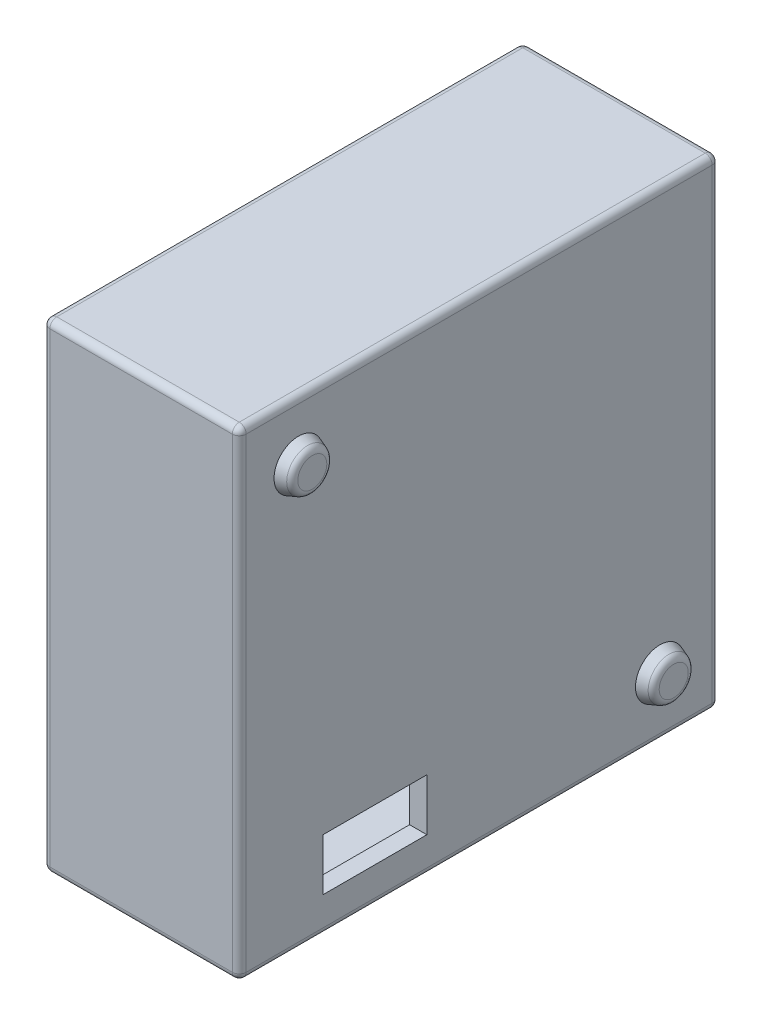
ISO-10303-21;
HEADER;
FILE_DESCRIPTION(('STEP AP214'),'2;1');
FILE_NAME('part.step','',(''),(''),'','','');
FILE_SCHEMA(('AUTOMOTIVE_DESIGN { 1 0 10303 214 1 1 1 1 }'));
ENDSEC;
DATA;
#1=APPLICATION_CONTEXT('core data for automotive mechanical design processes');
#2=APPLICATION_PROTOCOL_DEFINITION('international standard','automotive_design',2000,#1);
#3=PRODUCT_CONTEXT('',#1,'mechanical');
#4=PRODUCT('Part','Part','',(#3));
#5=PRODUCT_RELATED_PRODUCT_CATEGORY('part','',(#4));
#6=PRODUCT_DEFINITION_FORMATION('','',#4);
#7=PRODUCT_DEFINITION_CONTEXT('part definition',#1,'design');
#8=PRODUCT_DEFINITION('design','',#6,#7);
#9=PRODUCT_DEFINITION_SHAPE('','',#8);
#10=(LENGTH_UNIT() NAMED_UNIT(*) SI_UNIT(.MILLI.,.METRE.));
#11=(NAMED_UNIT(*) PLANE_ANGLE_UNIT() SI_UNIT($,.RADIAN.));
#12=(NAMED_UNIT(*) SI_UNIT($,.STERADIAN.) SOLID_ANGLE_UNIT());
#13=UNCERTAINTY_MEASURE_WITH_UNIT(LENGTH_MEASURE(1.E-05),#10,'distance_accuracy_value','');
#14=(GEOMETRIC_REPRESENTATION_CONTEXT(3) GLOBAL_UNCERTAINTY_ASSIGNED_CONTEXT((#13)) GLOBAL_UNIT_ASSIGNED_CONTEXT((#10,
#11,#12)) REPRESENTATION_CONTEXT('',''));
#15=CARTESIAN_POINT('',(0.,0.,0.));
#16=DIRECTION('',(0.,0.,1.));
#17=DIRECTION('',(1.,0.,0.));
#18=AXIS2_PLACEMENT_3D('',#15,#16,#17);
#19=CARTESIAN_POINT('',(14.2748,-17.6022,17.6022));
#20=DIRECTION('',(1.,0.,0.));
#21=DIRECTION('',(0.,0.,-1.));
#22=AXIS2_PLACEMENT_3D('',#19,#20,#21);
#23=PLANE('',#22);
#24=CARTESIAN_POINT('',(14.2748,-13.2588,-13.2588));
#25=DIRECTION('',(1.,0.,0.));
#26=DIRECTION('',(0.,0.,-1.));
#27=AXIS2_PLACEMENT_3D('',#24,#25,#26);
#28=CIRCLE('',#27,1.7907);
#29=CARTESIAN_POINT('',(14.2748,-13.2588,-15.0495));
#30=VERTEX_POINT('',#29);
#31=EDGE_CURVE('E1421',#30,#30,#28,.T.);
#32=ORIENTED_EDGE('',*,*,#31,.F.);
#33=EDGE_LOOP('',(#32));
#34=FACE_BOUND('',#33,.T.);
#35=DIRECTION('',(0.,1.,0.));
#36=VECTOR('',#35,1.);
#37=CARTESIAN_POINT('',(14.2748,-14.986,3.8354));
#38=LINE('',#37,#36);
#39=CARTESIAN_POINT('',(14.2748,-14.986,3.8354));
#40=VERTEX_POINT('',#39);
#41=CARTESIAN_POINT('',(14.2748,-11.176,3.8354));
#42=VERTEX_POINT('',#41);
#43=EDGE_CURVE('E48',#40,#42,#38,.T.);
#44=ORIENTED_EDGE('',*,*,#43,.F.);
#45=DIRECTION('',(0.,0.,-1.));
#46=VECTOR('',#45,1.);
#47=CARTESIAN_POINT('',(14.2748,-14.986,3.8354));
#48=LINE('',#47,#46);
#49=CARTESIAN_POINT('',(14.2748,-14.986,11.4554));
#50=VERTEX_POINT('',#49);
#51=EDGE_CURVE('E425',#50,#40,#48,.T.);
#52=ORIENTED_EDGE('',*,*,#51,.F.);
#53=DIRECTION('',(0.,-1.,0.));
#54=VECTOR('',#53,1.);
#55=CARTESIAN_POINT('',(14.2748,-14.986,11.4554));
#56=LINE('',#55,#54);
#57=CARTESIAN_POINT('',(14.2748,-11.176,11.4554));
#58=VERTEX_POINT('',#57);
#59=EDGE_CURVE('E422',#58,#50,#56,.T.);
#60=ORIENTED_EDGE('',*,*,#59,.F.);
#61=DIRECTION('',(0.,0.,1.));
#62=VECTOR('',#61,1.);
#63=CARTESIAN_POINT('',(14.2748,-11.176,3.8354));
#64=LINE('',#63,#62);
#65=EDGE_CURVE('E419',#42,#58,#64,.T.);
#66=ORIENTED_EDGE('',*,*,#65,.F.);
#67=EDGE_LOOP('',(#44,#52,#60,#66));
#68=FACE_BOUND('',#67,.T.);
#69=DIRECTION('',(0.,1.,0.));
#70=VECTOR('',#69,1.);
#71=CARTESIAN_POINT('',(14.2748,17.6022,-17.0942));
#72=LINE('',#71,#70);
#73=CARTESIAN_POINT('',(14.2748,-17.0942,-17.0942));
#74=VERTEX_POINT('',#73);
#75=CARTESIAN_POINT('',(14.2748,17.0942,-17.0942));
#76=VERTEX_POINT('',#75);
#77=EDGE_CURVE('E627',#74,#76,#72,.T.);
#78=ORIENTED_EDGE('',*,*,#77,.T.);
#79=DIRECTION('',(0.,0.,1.));
#80=VECTOR('',#79,1.);
#81=CARTESIAN_POINT('',(14.2748,17.0942,17.6022));
#82=LINE('',#81,#80);
#83=CARTESIAN_POINT('',(14.2748,17.0942,17.0942));
#84=VERTEX_POINT('',#83);
#85=EDGE_CURVE('E629',#76,#84,#82,.T.);
#86=ORIENTED_EDGE('',*,*,#85,.T.);
#87=DIRECTION('',(0.,-1.,0.));
#88=VECTOR('',#87,1.);
#89=CARTESIAN_POINT('',(14.2748,-17.6022,17.0942));
#90=LINE('',#89,#88);
#91=CARTESIAN_POINT('',(14.2748,-17.0942,17.0942));
#92=VERTEX_POINT('',#91);
#93=EDGE_CURVE('E623',#84,#92,#90,.T.);
#94=ORIENTED_EDGE('',*,*,#93,.T.);
#95=DIRECTION('',(0.,0.,-1.));
#96=VECTOR('',#95,1.);
#97=CARTESIAN_POINT('',(14.2748,-17.0942,-17.6022));
#98=LINE('',#97,#96);
#99=EDGE_CURVE('E625',#92,#74,#98,.T.);
#100=ORIENTED_EDGE('',*,*,#99,.T.);
#101=EDGE_LOOP('',(#78,#86,#94,#100));
#102=FACE_BOUND('',#101,.T.);
#103=CARTESIAN_POINT('',(14.2748,13.2588,13.2588));
#104=DIRECTION('',(1.,0.,0.));
#105=DIRECTION('',(0.,0.,-1.));
#106=AXIS2_PLACEMENT_3D('',#103,#104,#105);
#107=CIRCLE('',#106,1.7907);
#108=CARTESIAN_POINT('',(14.2748,13.2588,11.4681));
#109=VERTEX_POINT('',#108);
#110=EDGE_CURVE('E1423',#109,#109,#107,.T.);
#111=ORIENTED_EDGE('',*,*,#110,.F.);
#112=EDGE_LOOP('',(#111));
#113=FACE_BOUND('',#112,.T.);
#114=ADVANCED_FACE('F33',(#34,#68,#102,#113),#23,.T.);
#115=CARTESIAN_POINT('',(-6.35,0.,0.));
#116=DIRECTION('',(1.,0.,0.));
#117=DIRECTION('',(0.,0.,-1.));
#118=AXIS2_PLACEMENT_3D('',#115,#116,#117);
#119=CYLINDRICAL_SURFACE('',#118,8.19166591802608);
#120=CARTESIAN_POINT('',(0.,0.,0.));
#121=DIRECTION('',(0.902235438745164,0.304935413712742,-0.304935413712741));
#122=DIRECTION('',(0.43124379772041,-0.637976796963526,0.637976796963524));
#123=AXIS2_PLACEMENT_3D('',#120,#121,#122);
#124=ELLIPSE('',#123,9.07929966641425,8.19166591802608);
#125=CARTESIAN_POINT('',(0.,-5.79238251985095,-5.79238251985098));
#126=VERTEX_POINT('',#125);
#127=CARTESIAN_POINT('',(-2.7686,0.,-8.19166591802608));
#128=VERTEX_POINT('',#127);
#129=EDGE_CURVE('E466',#126,#128,#124,.T.);
#130=ORIENTED_EDGE('',*,*,#129,.F.);
#131=CARTESIAN_POINT('',(0.,0.,0.));
#132=DIRECTION('',(0.902235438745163,-0.304935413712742,0.304935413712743));
#133=DIRECTION('',(0.431243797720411,0.637976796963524,-0.637976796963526));
#134=AXIS2_PLACEMENT_3D('',#131,#132,#133);
#135=ELLIPSE('',#134,9.07929966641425,8.19166591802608);
#136=CARTESIAN_POINT('',(-2.7686,-8.19166591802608,0.));
#137=VERTEX_POINT('',#136);
#138=EDGE_CURVE('E463',#137,#126,#135,.T.);
#139=ORIENTED_EDGE('',*,*,#138,.F.);
#140=CARTESIAN_POINT('',(0.,0.,0.));
#141=DIRECTION('',(0.902235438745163,-0.304935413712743,-0.304935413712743));
#142=DIRECTION('',(0.431243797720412,0.637976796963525,0.637976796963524));
#143=AXIS2_PLACEMENT_3D('',#140,#141,#142);
#144=ELLIPSE('',#143,9.07929966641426,8.19166591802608);
#145=CARTESIAN_POINT('',(0.,-5.79238251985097,5.79238251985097));
#146=VERTEX_POINT('',#145);
#147=EDGE_CURVE('E460',#146,#137,#144,.T.);
#148=ORIENTED_EDGE('',*,*,#147,.F.);
#149=CARTESIAN_POINT('',(0.,0.,0.));
#150=DIRECTION('',(0.902235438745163,0.304935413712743,0.304935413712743));
#151=DIRECTION('',(0.431243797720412,-0.637976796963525,-0.637976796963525));
#152=AXIS2_PLACEMENT_3D('',#149,#150,#151);
#153=ELLIPSE('',#152,9.07929966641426,8.19166591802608);
#154=CARTESIAN_POINT('',(-2.7686,0.,8.19166591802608));
#155=VERTEX_POINT('',#154);
#156=EDGE_CURVE('E454',#155,#146,#153,.T.);
#157=ORIENTED_EDGE('',*,*,#156,.F.);
#158=CARTESIAN_POINT('',(0.,0.,0.));
#159=DIRECTION('',(0.902235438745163,-0.304935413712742,0.304935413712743));
#160=DIRECTION('',(0.431243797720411,0.637976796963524,-0.637976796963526));
#161=AXIS2_PLACEMENT_3D('',#158,#159,#160);
#162=ELLIPSE('',#161,9.07929966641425,8.19166591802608);
#163=CARTESIAN_POINT('',(0.,5.79238251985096,5.79238251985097));
#164=VERTEX_POINT('',#163);
#165=EDGE_CURVE('E56',#164,#155,#162,.T.);
#166=ORIENTED_EDGE('',*,*,#165,.F.);
#167=CARTESIAN_POINT('',(0.,0.,0.));
#168=DIRECTION('',(0.902235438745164,0.304935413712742,-0.304935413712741));
#169=DIRECTION('',(0.43124379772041,-0.637976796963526,0.637976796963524));
#170=AXIS2_PLACEMENT_3D('',#167,#168,#169);
#171=ELLIPSE('',#170,9.07929966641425,8.19166591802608);
#172=CARTESIAN_POINT('',(-2.76860000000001,8.19166591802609,0.));
#173=VERTEX_POINT('',#172);
#174=EDGE_CURVE('E656',#173,#164,#171,.T.);
#175=ORIENTED_EDGE('',*,*,#174,.F.);
#176=CARTESIAN_POINT('',(0.,0.,0.));
#177=DIRECTION('',(0.902235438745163,0.304935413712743,0.304935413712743));
#178=DIRECTION('',(0.431243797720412,-0.637976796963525,-0.637976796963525));
#179=AXIS2_PLACEMENT_3D('',#176,#177,#178);
#180=ELLIPSE('',#179,9.07929966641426,8.19166591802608);
#181=CARTESIAN_POINT('',(0.,5.79238251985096,-5.79238251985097));
#182=VERTEX_POINT('',#181);
#183=EDGE_CURVE('E451',#182,#173,#180,.T.);
#184=ORIENTED_EDGE('',*,*,#183,.F.);
#185=CARTESIAN_POINT('',(0.,0.,0.));
#186=DIRECTION('',(0.902235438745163,-0.304935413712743,-0.304935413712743));
#187=DIRECTION('',(0.431243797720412,0.637976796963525,0.637976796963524));
#188=AXIS2_PLACEMENT_3D('',#185,#186,#187);
#189=ELLIPSE('',#188,9.07929966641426,8.19166591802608);
#190=EDGE_CURVE('E457',#128,#182,#189,.T.);
#191=ORIENTED_EDGE('',*,*,#190,.F.);
#192=EDGE_LOOP('',(#130,#139,#148,#157,#166,#175,#184,#191));
#193=FACE_BOUND('',#192,.T.);
#194=CARTESIAN_POINT('',(-5.842,0.,0.));
#195=DIRECTION('',(1.,0.,0.));
#196=DIRECTION('',(0.,0.,-1.));
#197=AXIS2_PLACEMENT_3D('',#194,#195,#196);
#198=CIRCLE('',#197,8.19166591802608);
#199=CARTESIAN_POINT('',(-5.842,0.,-8.19166591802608));
#200=VERTEX_POINT('',#199);
#201=EDGE_CURVE('E658',#200,#200,#198,.T.);
#202=ORIENTED_EDGE('',*,*,#201,.T.);
#203=EDGE_LOOP('',(#202));
#204=FACE_BOUND('',#203,.T.);
#205=CARTESIAN_POINT('',(-3.048,-8.19166591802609,0.));
#206=CARTESIAN_POINT('',(-3.04800214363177,-8.19166530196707,0.0497784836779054));
#207=CARTESIAN_POINT('',(-3.05219501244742,-8.19120737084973,0.0995893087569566));
#208=CARTESIAN_POINT('',(-3.0688569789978,-8.18942463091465,0.197828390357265));
#209=CARTESIAN_POINT('',(-3.08133504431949,-8.18809888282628,0.246255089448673));
#210=CARTESIAN_POINT('',(-3.11419845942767,-8.18473006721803,0.340289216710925));
#211=CARTESIAN_POINT('',(-3.13457885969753,-8.18268744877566,0.385898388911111));
#212=CARTESIAN_POINT('',(-3.18265840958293,-8.17811290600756,0.473039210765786));
#213=CARTESIAN_POINT('',(-3.21035616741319,-8.17558107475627,0.51457163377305));
#214=CARTESIAN_POINT('',(-3.27240896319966,-8.17029952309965,0.592564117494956));
#215=CARTESIAN_POINT('',(-3.30678853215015,-8.16754902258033,0.629004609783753));
#216=CARTESIAN_POINT('',(-3.38117656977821,-8.16214652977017,0.695610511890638));
#217=CARTESIAN_POINT('',(-3.42118530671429,-8.15949454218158,0.725775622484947));
#218=CARTESIAN_POINT('',(-3.50582011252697,-8.15458149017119,0.779045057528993));
#219=CARTESIAN_POINT('',(-3.55045752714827,-8.15232142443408,0.802131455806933));
#220=CARTESIAN_POINT('',(-3.64300414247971,-8.14845801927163,0.840473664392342));
#221=CARTESIAN_POINT('',(-3.69091324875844,-8.14685466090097,0.855729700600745));
#222=CARTESIAN_POINT('',(-3.78844240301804,-8.14449341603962,0.877919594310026));
#223=CARTESIAN_POINT('',(-3.83805493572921,-8.14373221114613,0.884886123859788));
#224=CARTESIAN_POINT('',(-3.93775041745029,-8.1431312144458,0.890400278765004));
#225=CARTESIAN_POINT('',(-3.98783335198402,-8.14329139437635,0.888948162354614));
#226=CARTESIAN_POINT('',(-4.08682196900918,-8.14451203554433,0.877693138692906));
#227=CARTESIAN_POINT('',(-4.13573177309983,-8.14556864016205,0.867926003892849));
#228=CARTESIAN_POINT('',(-4.23121388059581,-8.1484570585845,0.840373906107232));
#229=CARTESIAN_POINT('',(-4.27778614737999,-8.15028888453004,0.822588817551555));
#230=CARTESIAN_POINT('',(-4.36738357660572,-8.15452576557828,0.779466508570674));
#231=CARTESIAN_POINT('',(-4.41040109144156,-8.15693201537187,0.754113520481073));
#232=CARTESIAN_POINT('',(-4.49158418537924,-8.1620456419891,0.696586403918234));
#233=CARTESIAN_POINT('',(-4.52974959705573,-8.16475302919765,0.664412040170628));
#234=CARTESIAN_POINT('',(-4.60035290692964,-8.17018105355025,0.593956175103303));
#235=CARTESIAN_POINT('',(-4.63276000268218,-8.17290168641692,0.555643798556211));
#236=CARTESIAN_POINT('',(-4.69068767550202,-8.17803640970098,0.474106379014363));
#237=CARTESIAN_POINT('',(-4.71620824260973,-8.18045049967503,0.430881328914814));
#238=CARTESIAN_POINT('',(-4.75963758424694,-8.18470113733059,0.340723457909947));
#239=CARTESIAN_POINT('',(-4.77754468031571,-8.18653755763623,0.293789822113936));
#240=CARTESIAN_POINT('',(-4.80521559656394,-8.18942469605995,0.197557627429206));
#241=CARTESIAN_POINT('',(-4.81497970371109,-8.1904754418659,0.148259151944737));
#242=CARTESIAN_POINT('',(-4.82604813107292,-8.19166927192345,0.0489632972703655));
#243=CARTESIAN_POINT('',(-4.82739493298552,-8.19181691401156,-0.00102929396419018));
#244=CARTESIAN_POINT('',(-4.82170226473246,-8.1912001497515,-0.100528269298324));
#245=CARTESIAN_POINT('',(-4.81466292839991,-8.19043575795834,-0.150034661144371));
#246=CARTESIAN_POINT('',(-4.79243306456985,-8.18808370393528,-0.247032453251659));
#247=CARTESIAN_POINT('',(-4.77726254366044,-8.18649806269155,-0.294528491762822));
#248=CARTESIAN_POINT('',(-4.73922158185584,-8.18268127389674,-0.386301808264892));
#249=CARTESIAN_POINT('',(-4.71635093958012,-8.18045010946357,-0.430579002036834));
#250=CARTESIAN_POINT('',(-4.66345440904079,-8.17558020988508,-0.51484909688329));
#251=CARTESIAN_POINT('',(-4.63340074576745,-8.17293990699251,-0.554824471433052));
#252=CARTESIAN_POINT('',(-4.56703094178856,-8.16755271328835,-0.629178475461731));
#253=CARTESIAN_POINT('',(-4.53071461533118,-8.16480581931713,-0.663556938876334));
#254=CARTESIAN_POINT('',(-4.45266444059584,-8.15950120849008,-0.725889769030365));
#255=CARTESIAN_POINT('',(-4.41090818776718,-8.1569443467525,-0.753816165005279));
#256=CARTESIAN_POINT('',(-4.32327340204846,-8.15232266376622,-0.80225955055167));
#257=CARTESIAN_POINT('',(-4.27739493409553,-8.15025783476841,-0.822776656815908));
#258=CARTESIAN_POINT('',(-4.18291216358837,-8.14685951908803,-0.85577271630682));
#259=CARTESIAN_POINT('',(-4.13431363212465,-8.14552454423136,-0.868268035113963));
#260=CARTESIAN_POINT('',(-4.03569295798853,-8.14373258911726,-0.884918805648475));
#261=CARTESIAN_POINT('',(-3.98567086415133,-8.14327557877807,-0.889074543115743));
#262=CARTESIAN_POINT('',(-3.88590108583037,-8.1432920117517,-0.888923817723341));
#263=CARTESIAN_POINT('',(-3.83615332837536,-8.14376062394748,-0.884661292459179));
#264=CARTESIAN_POINT('',(-3.73808528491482,-8.14556517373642,-0.867887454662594));
#265=CARTESIAN_POINT('',(-3.68976500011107,-8.14690111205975,-0.855376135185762));
#266=CARTESIAN_POINT('',(-3.5959256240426,-8.15028839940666,-0.822472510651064));
#267=CARTESIAN_POINT('',(-3.55040598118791,-8.15233960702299,-0.802081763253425));
#268=CARTESIAN_POINT('',(-3.46342794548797,-8.1569265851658,-0.754002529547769));
#269=CARTESIAN_POINT('',(-3.42196955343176,-8.15946235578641,-0.726314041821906));
#270=CARTESIAN_POINT('',(-3.34406578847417,-8.16474861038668,-0.6642607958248));
#271=CARTESIAN_POINT('',(-3.30764658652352,-8.16750010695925,-0.629863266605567));
#272=CARTESIAN_POINT('',(-3.24107891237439,-8.17289861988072,-0.555434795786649));
#273=CARTESIAN_POINT('',(-3.21093193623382,-8.1755456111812,-0.515402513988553));
#274=CARTESIAN_POINT('',(-3.15769317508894,-8.18044508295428,-0.430710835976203));
#275=CARTESIAN_POINT('',(-3.13462220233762,-8.18269639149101,-0.386038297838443));
#276=CARTESIAN_POINT('',(-3.09634058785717,-8.18653845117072,-0.293456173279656));
#277=CARTESIAN_POINT('',(-3.08112118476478,-8.18812993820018,-0.245550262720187));
#278=CARTESIAN_POINT('',(-3.06272200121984,-8.19007824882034,-0.164483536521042));
#279=CARTESIAN_POINT('',(-3.05720891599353,-8.19067080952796,-0.131838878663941));
#280=CARTESIAN_POINT('',(-3.04984721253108,-8.19146484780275,-0.0661342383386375));
#281=CARTESIAN_POINT('',(-3.04799857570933,-8.19166632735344,-0.0330742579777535));
#282=CARTESIAN_POINT('',(-3.048,-8.19166591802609,0.));
#283=B_SPLINE_CURVE_WITH_KNOTS('',3,(#205,#206,#207,#208,#209,#210,#211,#212,#213,#214,#215,
#216,#217,#218,#219,#220,#221,#222,#223,#224,#225,#226,#227,#228,#229,#230,#231,#232,#233,#234,
#235,#236,#237,#238,#239,#240,#241,#242,#243,#244,#245,#246,#247,#248,#249,#250,#251,#252,#253,
#254,#255,#256,#257,#258,#259,#260,#261,#262,#263,#264,#265,#266,#267,#268,#269,#270,#271,#272,
#273,#274,#275,#276,#277,#278,#279,#280,#281,#282),.UNSPECIFIED.,.T.,.F.,(4,2,2,2,2,2,2,2,2,2,2,
2,2,2,2,2,2,2,2,2,2,2,2,2,2,2,2,2,2,2,2,2,2,2,2,2,2,2,4),(0.,0.149214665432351,
0.298591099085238,0.447874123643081,0.597128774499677,0.746942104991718,0.896762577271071,
1.04695938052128,1.19715185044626,1.34675037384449,1.49634430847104,1.64529790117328,
1.79425382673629,1.94352229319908,2.09279590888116,2.24284543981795,2.39289518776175,
2.54297799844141,2.69305551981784,2.84237499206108,2.99169208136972,3.14064345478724,
3.28959872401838,3.43913956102,3.58868483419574,3.73886672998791,3.88904626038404,
4.03891842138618,4.18878544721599,4.33787233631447,4.48695935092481,4.63601690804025,
4.78507449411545,4.93487927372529,5.08471974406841,5.23499679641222,5.3851057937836,
5.48424881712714,5.58339133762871),.UNSPECIFIED.);
#284=CARTESIAN_POINT('',(-3.048,-8.19166591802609,0.));
#285=VERTEX_POINT('',#284);
#286=EDGE_CURVE('E1014',#285,#285,#283,.T.);
#287=ORIENTED_EDGE('',*,*,#286,.F.);
#288=EDGE_LOOP('',(#287));
#289=FACE_BOUND('',#288,.T.);
#290=ADVANCED_FACE('F686',(#193,#204,#289),#119,.T.);
#291=CARTESIAN_POINT('',(30.9421553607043,0.,0.));
#292=DIRECTION('',(-1.,0.,0.));
#293=DIRECTION('',(0.,0.,1.));
#294=AXIS2_PLACEMENT_3D('',#291,#292,#293);
#295=CYLINDRICAL_SURFACE('',#294,5.8928);
#296=CARTESIAN_POINT('',(7.9248,0.,0.));
#297=DIRECTION('',(1.,0.,0.));
#298=DIRECTION('',(0.,0.,-1.));
#299=AXIS2_PLACEMENT_3D('',#296,#297,#298);
#300=CIRCLE('',#299,5.8928);
#301=CARTESIAN_POINT('',(7.9248,0.,-5.8928));
#302=VERTEX_POINT('',#301);
#303=EDGE_CURVE('E447',#302,#302,#300,.F.);
#304=ORIENTED_EDGE('',*,*,#303,.F.);
#305=EDGE_LOOP('',(#304));
#306=FACE_BOUND('',#305,.T.);
#307=CARTESIAN_POINT('',(-6.35,0.,0.));
#308=DIRECTION('',(-1.,0.,0.));
#309=DIRECTION('',(0.,0.,1.));
#310=AXIS2_PLACEMENT_3D('',#307,#308,#309);
#311=CIRCLE('',#310,5.8928);
#312=CARTESIAN_POINT('',(-6.35,0.,5.8928));
#313=VERTEX_POINT('',#312);
#314=EDGE_CURVE('E439',#313,#313,#311,.T.);
#315=ORIENTED_EDGE('',*,*,#314,.T.);
#316=EDGE_LOOP('',(#315));
#317=FACE_BOUND('',#316,.T.);
#318=CARTESIAN_POINT('',(-3.048,-5.8928,0.));
#319=CARTESIAN_POINT('',(-3.04800204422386,-5.89279920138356,0.0496333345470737));
#320=CARTESIAN_POINT('',(-3.0521706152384,-5.89216635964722,0.0992953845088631));
#321=CARTESIAN_POINT('',(-3.06873040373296,-5.88970273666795,0.197231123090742));
#322=CARTESIAN_POINT('',(-3.0811296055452,-5.88787079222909,0.245503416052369));
#323=CARTESIAN_POINT('',(-3.11377153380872,-5.88321481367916,0.339228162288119));
#324=CARTESIAN_POINT('',(-3.13400830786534,-5.88039153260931,0.384682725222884));
#325=CARTESIAN_POINT('',(-3.1817363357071,-5.87406477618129,0.471544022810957));
#326=CARTESIAN_POINT('',(-3.20922659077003,-5.87056139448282,0.512951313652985));
#327=CARTESIAN_POINT('',(-3.2709125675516,-5.86323302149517,0.590876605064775));
#328=CARTESIAN_POINT('',(-3.30515427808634,-5.8594059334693,0.627358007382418));
#329=CARTESIAN_POINT('',(-3.37927220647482,-5.8518778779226,0.694080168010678));
#330=CARTESIAN_POINT('',(-3.41914874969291,-5.84817691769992,0.724320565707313));
#331=CARTESIAN_POINT('',(-3.50365056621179,-5.84129980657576,0.777844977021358));
#332=CARTESIAN_POINT('',(-3.54829853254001,-5.83812636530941,0.801093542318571));
#333=CARTESIAN_POINT('',(-3.64092144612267,-5.83269224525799,0.839747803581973));
#334=CARTESIAN_POINT('',(-3.68889620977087,-5.83043151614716,0.855153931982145));
#335=CARTESIAN_POINT('',(-3.78642584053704,-5.8270994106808,0.87757225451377));
#336=CARTESIAN_POINT('',(-3.83596599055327,-5.82601915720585,0.884647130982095));
#337=CARTESIAN_POINT('',(-3.9355411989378,-5.82514336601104,0.890396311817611));
#338=CARTESIAN_POINT('',(-3.98557622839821,-5.8253477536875,0.889071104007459));
#339=CARTESIAN_POINT('',(-4.08427785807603,-5.82701003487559,0.878108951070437));
#340=CARTESIAN_POINT('',(-4.13295241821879,-5.82845739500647,0.868541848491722));
#341=CARTESIAN_POINT('',(-4.22799740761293,-5.83242608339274,0.841476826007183));
#342=CARTESIAN_POINT('',(-4.27436777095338,-5.83494744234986,0.823978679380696));
#343=CARTESIAN_POINT('',(-4.3637004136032,-5.84079165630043,0.781475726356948));
#344=CARTESIAN_POINT('',(-4.40664841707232,-5.84411765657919,0.756441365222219));
#345=CARTESIAN_POINT('',(-4.48776049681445,-5.85119412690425,0.69959766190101));
#346=CARTESIAN_POINT('',(-4.52592425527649,-5.85494462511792,0.667787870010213));
#347=CARTESIAN_POINT('',(-4.59678927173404,-5.8624940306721,0.597913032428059));
#348=CARTESIAN_POINT('',(-4.62943134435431,-5.86629304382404,0.559787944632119));
#349=CARTESIAN_POINT('',(-4.68786287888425,-5.87347618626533,0.47856930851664));
#350=CARTESIAN_POINT('',(-4.71365231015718,-5.87686031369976,0.435475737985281));
#351=CARTESIAN_POINT('',(-4.75764965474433,-5.88283598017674,0.34549188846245));
#352=CARTESIAN_POINT('',(-4.7758529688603,-5.88542703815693,0.298599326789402));
#353=CARTESIAN_POINT('',(-4.80410972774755,-5.88952060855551,0.202375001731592));
#354=CARTESIAN_POINT('',(-4.81416372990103,-5.89102319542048,0.153043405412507));
#355=CARTESIAN_POINT('',(-4.82575769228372,-5.89276065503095,0.0538521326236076));
#356=CARTESIAN_POINT('',(-4.82737901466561,-5.89300764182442,0.00400217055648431));
#357=CARTESIAN_POINT('',(-4.82227760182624,-5.8922390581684,-0.095257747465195));
#358=CARTESIAN_POINT('',(-4.81555512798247,-5.89122352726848,-0.144667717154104));
#359=CARTESIAN_POINT('',(-4.79402460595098,-5.88805150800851,-0.241398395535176));
#360=CARTESIAN_POINT('',(-4.77925622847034,-5.88590061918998,-0.288728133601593));
#361=CARTESIAN_POINT('',(-4.74209497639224,-5.88069826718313,-0.380239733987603));
#362=CARTESIAN_POINT('',(-4.7197017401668,-5.8776467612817,-0.424421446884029));
#363=CARTESIAN_POINT('',(-4.66773577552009,-5.87095215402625,-0.508740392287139));
#364=CARTESIAN_POINT('',(-4.63811147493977,-5.86730486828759,-0.548845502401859));
#365=CARTESIAN_POINT('',(-4.57259606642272,-5.85983759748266,-0.623543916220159));
#366=CARTESIAN_POINT('',(-4.53670458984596,-5.85601760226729,-0.658136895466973));
#367=CARTESIAN_POINT('',(-4.45931131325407,-5.84859700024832,-0.721125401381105));
#368=CARTESIAN_POINT('',(-4.4177648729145,-5.84499850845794,-0.749466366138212));
#369=CARTESIAN_POINT('',(-4.3304533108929,-5.83846590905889,-0.798767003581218));
#370=CARTESIAN_POINT('',(-4.28468830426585,-5.83553178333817,-0.819726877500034));
#371=CARTESIAN_POINT('',(-4.19040090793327,-5.83067546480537,-0.853585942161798));
#372=CARTESIAN_POINT('',(-4.14188899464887,-5.82874968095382,-0.866513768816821));
#373=CARTESIAN_POINT('',(-4.04335129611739,-5.8261185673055,-0.884032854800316));
#374=CARTESIAN_POINT('',(-3.99332561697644,-5.82541315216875,-0.888624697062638));
#375=CARTESIAN_POINT('',(-3.89372431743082,-5.82530585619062,-0.889327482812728));
#376=CARTESIAN_POINT('',(-3.84414929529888,-5.82589078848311,-0.885524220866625));
#377=CARTESIAN_POINT('',(-3.74635254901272,-5.82826960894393,-0.869728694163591));
#378=CARTESIAN_POINT('',(-3.69813082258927,-5.83006349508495,-0.857736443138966));
#379=CARTESIAN_POINT('',(-3.60443374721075,-5.83465346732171,-0.825933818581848));
#380=CARTESIAN_POINT('',(-3.55895629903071,-5.83744877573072,-0.806129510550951));
#381=CARTESIAN_POINT('',(-3.47195566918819,-5.84372756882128,-0.759273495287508));
#382=CARTESIAN_POINT('',(-3.43043262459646,-5.84721107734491,-0.732221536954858));
#383=CARTESIAN_POINT('',(-3.35208371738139,-5.85451613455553,-0.671326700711));
#384=CARTESIAN_POINT('',(-3.3153074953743,-5.85834064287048,-0.6374203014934));
#385=CARTESIAN_POINT('',(-3.24793639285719,-5.86587212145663,-0.563913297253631));
#386=CARTESIAN_POINT('',(-3.21734295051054,-5.86957906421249,-0.524311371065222));
#387=CARTESIAN_POINT('',(-3.16305339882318,-5.87648134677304,-0.440277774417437));
#388=CARTESIAN_POINT('',(-3.13939666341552,-5.87967372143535,-0.395820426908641));
#389=CARTESIAN_POINT('',(-3.09992152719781,-5.88515810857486,-0.303535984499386));
#390=CARTESIAN_POINT('',(-3.08409502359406,-5.88745105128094,-0.255712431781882));
#391=CARTESIAN_POINT('',(-3.06431235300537,-5.89035596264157,-0.1730631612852));
#392=CARTESIAN_POINT('',(-3.05820459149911,-5.89126776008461,-0.138747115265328));
#393=CARTESIAN_POINT('',(-3.05004772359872,-5.89249005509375,-0.0696254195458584));
#394=CARTESIAN_POINT('',(-3.04799856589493,-5.89280056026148,-0.03481977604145));
#395=CARTESIAN_POINT('',(-3.048,-5.8928,0.));
#396=B_SPLINE_CURVE_WITH_KNOTS('',3,(#318,#319,#320,#321,#322,#323,#324,#325,#326,#327,#328,
#329,#330,#331,#332,#333,#334,#335,#336,#337,#338,#339,#340,#341,#342,#343,#344,#345,#346,#347,
#348,#349,#350,#351,#352,#353,#354,#355,#356,#357,#358,#359,#360,#361,#362,#363,#364,#365,#366,
#367,#368,#369,#370,#371,#372,#373,#374,#375,#376,#377,#378,#379,#380,#381,#382,#383,#384,#385,
#386,#387,#388,#389,#390,#391,#392,#393,#394,#395),.UNSPECIFIED.,.T.,.F.,(4,2,2,2,2,2,2,2,2,2,2,
2,2,2,2,2,2,2,2,2,2,2,2,2,2,2,2,2,2,2,2,2,2,2,2,2,2,2,4),(0.,0.148772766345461,
0.297690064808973,0.446494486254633,0.595278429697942,0.745113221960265,0.894956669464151,
1.04554748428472,1.1961299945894,1.34557216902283,1.49500566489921,1.64318516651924,
1.7913689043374,1.94014151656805,2.08892400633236,2.23921208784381,2.3895008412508,
2.53988057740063,2.6902500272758,2.83916591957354,2.98807714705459,3.13626071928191,
3.28445132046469,3.43373139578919,3.58302025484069,3.73356451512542,3.8841046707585,
4.0341049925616,4.18409482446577,4.33255892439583,4.48102277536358,4.62937158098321,
4.77772552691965,4.92752311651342,5.07735551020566,5.22802260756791,5.37853346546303,
5.48290485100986,5.58727491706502),.UNSPECIFIED.);
#397=CARTESIAN_POINT('',(-3.048,-5.8928,0.));
#398=VERTEX_POINT('',#397);
#399=EDGE_CURVE('E1007',#398,#398,#396,.T.);
#400=ORIENTED_EDGE('',*,*,#399,.T.);
#401=EDGE_LOOP('',(#400));
#402=FACE_BOUND('',#401,.T.);
#403=ADVANCED_FACE('F692',(#306,#317,#402),#295,.F.);
#404=CARTESIAN_POINT('',(-2.7686,21.698032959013,-13.506367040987));
#405=DIRECTION('',(0.902235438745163,0.304935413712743,0.304935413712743));
#406=DIRECTION('',(-0.320184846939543,0.947355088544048,0.));
#407=AXIS2_PLACEMENT_3D('',#404,#405,#406);
#408=PLANE('',#407);
#409=DIRECTION('',(-0.137393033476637,0.873517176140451,-0.467002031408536));
#410=VECTOR('',#409,1.);
#411=CARTESIAN_POINT('',(-4.225062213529,9.25989278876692,3.24111787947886));
#412=LINE('',#411,#410);
#413=CARTESIAN_POINT('',(-0.107272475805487,-16.9201832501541,17.2375784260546));
#414=VERTEX_POINT('',#413);
#415=EDGE_CURVE('E545',#414,#155,#412,.T.);
#416=ORIENTED_EDGE('',*,*,#415,.T.);
#417=ORIENTED_EDGE('',*,*,#156,.T.);
#418=DIRECTION('',(0.,-0.707106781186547,0.707106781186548));
#419=VECTOR('',#418,1.);
#420=CARTESIAN_POINT('',(0.,17.6022,-17.6022));
#421=LINE('',#420,#419);
#422=CARTESIAN_POINT('',(0.,-17.3325356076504,17.3325356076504));
#423=VERTEX_POINT('',#422);
#424=EDGE_CURVE('E532',#146,#423,#421,.T.);
#425=ORIENTED_EDGE('',*,*,#424,.T.);
#426=CARTESIAN_POINT('',(0.0706828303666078,-17.198767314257,16.989632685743));
#427=DIRECTION('',(0.902235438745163,0.304935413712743,0.304935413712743));
#428=DIRECTION('',(-0.320184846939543,0.947355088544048,0.));
#429=AXIS2_PLACEMENT_3D('',#426,#427,#428);
#430=CIRCLE('',#429,0.374796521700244);
#431=CARTESIAN_POINT('',(-0.0757747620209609,-17.0942,17.3184005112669));
#432=VERTEX_POINT('',#431);
#433=EDGE_CURVE('E616',#423,#432,#430,.F.);
#434=ORIENTED_EDGE('',*,*,#433,.T.);
#435=CARTESIAN_POINT('',(0.380074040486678,-18.2187537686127,17.0942));
#436=DIRECTION('',(0.902235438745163,0.304935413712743,0.304935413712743));
#437=DIRECTION('',(-0.288882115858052,0.952373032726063,-0.0976356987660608));
#438=AXIS2_PLACEMENT_3D('',#435,#436,#437);
#439=ELLIPSE('',#438,1.66592654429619,0.508);
#440=EDGE_CURVE('E561',#432,#414,#439,.F.);
#441=ORIENTED_EDGE('',*,*,#440,.T.);
#442=EDGE_LOOP('',(#416,#417,#425,#434,#441));
#443=FACE_BOUND('',#442,.T.);
#444=ADVANCED_FACE('F809',(#443),#408,.F.);
#445=CARTESIAN_POINT('',(-2.7686,13.506367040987,-21.698032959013));
#446=DIRECTION('',(0.902235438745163,-0.304935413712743,-0.304935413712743));
#447=DIRECTION('',(0.320184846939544,0.947355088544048,0.));
#448=AXIS2_PLACEMENT_3D('',#445,#446,#447);
#449=PLANE('',#448);
#450=ORIENTED_EDGE('',*,*,#424,.F.);
#451=ORIENTED_EDGE('',*,*,#147,.T.);
#452=DIRECTION('',(0.137393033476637,-0.467002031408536,0.873517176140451));
#453=VECTOR('',#452,1.);
#454=CARTESIAN_POINT('',(0.,-17.6022,17.6022));
#455=LINE('',#454,#453);
#456=CARTESIAN_POINT('',(-0.107272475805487,-17.2375784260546,16.9201832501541));
#457=VERTEX_POINT('',#456);
#458=EDGE_CURVE('E536',#137,#457,#455,.T.);
#459=ORIENTED_EDGE('',*,*,#458,.T.);
#460=CARTESIAN_POINT('',(0.380074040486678,-17.0942,18.2187537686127));
#461=DIRECTION('',(0.902235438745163,-0.304935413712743,-0.304935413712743));
#462=DIRECTION('',(0.288882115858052,-0.0976356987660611,0.952373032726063));
#463=AXIS2_PLACEMENT_3D('',#460,#461,#462);
#464=ELLIPSE('',#463,1.66592654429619,0.508);
#465=CARTESIAN_POINT('',(-0.0757747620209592,-17.3184005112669,17.0942));
#466=VERTEX_POINT('',#465);
#467=EDGE_CURVE('E555',#457,#466,#464,.F.);
#468=ORIENTED_EDGE('',*,*,#467,.T.);
#469=CARTESIAN_POINT('',(0.0706828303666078,-16.989632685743,17.198767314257));
#470=DIRECTION('',(0.902235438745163,-0.304935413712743,-0.304935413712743));
#471=DIRECTION('',(0.320184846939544,0.947355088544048,0.));
#472=AXIS2_PLACEMENT_3D('',#469,#470,#471);
#473=CIRCLE('',#472,0.374796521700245);
#474=EDGE_CURVE('E613',#466,#423,#473,.F.);
#475=ORIENTED_EDGE('',*,*,#474,.T.);
#476=EDGE_LOOP('',(#450,#451,#459,#468,#475));
#477=FACE_BOUND('',#476,.T.);
#478=ADVANCED_FACE('F714',(#477),#449,.F.);
#479=CARTESIAN_POINT('',(14.2748,17.6022,17.6022));
#480=DIRECTION('',(0.,0.,-1.));
#481=DIRECTION('',(-1.,0.,0.));
#482=AXIS2_PLACEMENT_3D('',#479,#480,#481);
#483=PLANE('',#482);
#484=DIRECTION('',(0.,-1.,0.));
#485=VECTOR('',#484,1.);
#486=CARTESIAN_POINT('',(13.7668,17.6022,17.6022));
#487=LINE('',#486,#485);
#488=CARTESIAN_POINT('',(13.7668,-17.0942,17.6022));
#489=VERTEX_POINT('',#488);
#490=CARTESIAN_POINT('',(13.7668,17.0942,17.6022));
#491=VERTEX_POINT('',#490);
#492=EDGE_CURVE('E652',#489,#491,#487,.F.);
#493=ORIENTED_EDGE('',*,*,#492,.T.);
#494=DIRECTION('',(-1.,0.,0.));
#495=VECTOR('',#494,1.);
#496=CARTESIAN_POINT('',(14.2748,17.0942,17.6022));
#497=LINE('',#496,#495);
#498=CARTESIAN_POINT('',(0.380074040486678,17.0942,17.6022));
#499=VERTEX_POINT('',#498);
#500=EDGE_CURVE('E654',#491,#499,#497,.T.);
#501=ORIENTED_EDGE('',*,*,#500,.T.);
#502=DIRECTION('',(0.,-1.,0.));
#503=VECTOR('',#502,1.);
#504=CARTESIAN_POINT('',(0.380074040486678,-17.4312574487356,17.6022));
#505=LINE('',#504,#503);
#506=CARTESIAN_POINT('',(0.380074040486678,-17.0942,17.6022));
#507=VERTEX_POINT('',#506);
#508=EDGE_CURVE('E558',#499,#507,#505,.T.);
#509=ORIENTED_EDGE('',*,*,#508,.T.);
#510=DIRECTION('',(-1.,0.,0.));
#511=VECTOR('',#510,1.);
#512=CARTESIAN_POINT('',(14.2748,-17.0942,17.6022));
#513=LINE('',#512,#511);
#514=EDGE_CURVE('E650',#507,#489,#513,.F.);
#515=ORIENTED_EDGE('',*,*,#514,.T.);
#516=EDGE_LOOP('',(#493,#501,#509,#515));
#517=FACE_BOUND('',#516,.T.);
#518=ADVANCED_FACE('F35',(#517),#483,.F.);
#519=CARTESIAN_POINT('',(14.2748,-17.6022,17.6022));
#520=DIRECTION('',(0.,1.,0.));
#521=DIRECTION('',(0.,0.,1.));
#522=AXIS2_PLACEMENT_3D('',#519,#520,#521);
#523=PLANE('',#522);
#524=DIRECTION('',(0.,0.,-1.));
#525=VECTOR('',#524,1.);
#526=CARTESIAN_POINT('',(13.7668,-17.6022,17.6022));
#527=LINE('',#526,#525);
#528=CARTESIAN_POINT('',(13.7668,-17.6022,-17.0942));
#529=VERTEX_POINT('',#528);
#530=CARTESIAN_POINT('',(13.7668,-17.6022,17.0942));
#531=VERTEX_POINT('',#530);
#532=EDGE_CURVE('E646',#529,#531,#527,.F.);
#533=ORIENTED_EDGE('',*,*,#532,.T.);
#534=DIRECTION('',(-1.,0.,0.));
#535=VECTOR('',#534,1.);
#536=CARTESIAN_POINT('',(14.2748,-17.6022,17.0942));
#537=LINE('',#536,#535);
#538=CARTESIAN_POINT('',(0.380074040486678,-17.6022,17.0942));
#539=VERTEX_POINT('',#538);
#540=EDGE_CURVE('E648',#531,#539,#537,.T.);
#541=ORIENTED_EDGE('',*,*,#540,.T.);
#542=DIRECTION('',(0.,0.,-1.));
#543=VECTOR('',#542,1.);
#544=CARTESIAN_POINT('',(0.380074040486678,-17.6022,-17.6022));
#545=LINE('',#544,#543);
#546=CARTESIAN_POINT('',(0.380074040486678,-17.6022,-17.0942));
#547=VERTEX_POINT('',#546);
#548=EDGE_CURVE('E548',#539,#547,#545,.T.);
#549=ORIENTED_EDGE('',*,*,#548,.T.);
#550=DIRECTION('',(-1.,0.,0.));
#551=VECTOR('',#550,1.);
#552=CARTESIAN_POINT('',(14.2748,-17.6022,-17.0942));
#553=LINE('',#552,#551);
#554=EDGE_CURVE('E644',#547,#529,#553,.F.);
#555=ORIENTED_EDGE('',*,*,#554,.T.);
#556=EDGE_LOOP('',(#533,#541,#549,#555));
#557=FACE_BOUND('',#556,.T.);
#558=ADVANCED_FACE('F707',(#557),#523,.F.);
#559=CARTESIAN_POINT('',(14.2748,17.6022,-17.6022));
#560=DIRECTION('',(0.,0.,1.));
#561=DIRECTION('',(1.,0.,0.));
#562=AXIS2_PLACEMENT_3D('',#559,#560,#561);
#563=PLANE('',#562);
#564=DIRECTION('',(0.,1.,0.));
#565=VECTOR('',#564,1.);
#566=CARTESIAN_POINT('',(0.380074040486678,17.4312574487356,-17.6022));
#567=LINE('',#566,#565);
#568=CARTESIAN_POINT('',(0.380074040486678,-17.0942,-17.6022));
#569=VERTEX_POINT('',#568);
#570=CARTESIAN_POINT('',(0.380074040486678,17.0942,-17.6022));
#571=VERTEX_POINT('',#570);
#572=EDGE_CURVE('E578',#569,#571,#567,.T.);
#573=ORIENTED_EDGE('',*,*,#572,.T.);
#574=DIRECTION('',(-1.,0.,0.));
#575=VECTOR('',#574,1.);
#576=CARTESIAN_POINT('',(14.2748,17.0942,-17.6022));
#577=LINE('',#576,#575);
#578=CARTESIAN_POINT('',(13.7668,17.0942,-17.6022));
#579=VERTEX_POINT('',#578);
#580=EDGE_CURVE('E642',#571,#579,#577,.F.);
#581=ORIENTED_EDGE('',*,*,#580,.T.);
#582=DIRECTION('',(0.,1.,0.));
#583=VECTOR('',#582,1.);
#584=CARTESIAN_POINT('',(13.7668,-17.6022,-17.6022));
#585=LINE('',#584,#583);
#586=CARTESIAN_POINT('',(13.7668,-17.0942,-17.6022));
#587=VERTEX_POINT('',#586);
#588=EDGE_CURVE('E640',#579,#587,#585,.F.);
#589=ORIENTED_EDGE('',*,*,#588,.T.);
#590=DIRECTION('',(-1.,0.,0.));
#591=VECTOR('',#590,1.);
#592=CARTESIAN_POINT('',(14.2748,-17.0942,-17.6022));
#593=LINE('',#592,#591);
#594=EDGE_CURVE('E638',#587,#569,#593,.T.);
#595=ORIENTED_EDGE('',*,*,#594,.T.);
#596=EDGE_LOOP('',(#573,#581,#589,#595));
#597=FACE_BOUND('',#596,.T.);
#598=ADVANCED_FACE('F704',(#597),#563,.F.);
#599=CARTESIAN_POINT('',(14.2748,17.6022,17.6022));
#600=DIRECTION('',(0.,-1.,0.));
#601=DIRECTION('',(0.,0.,-1.));
#602=AXIS2_PLACEMENT_3D('',#599,#600,#601);
#603=PLANE('',#602);
#604=DIRECTION('',(0.,0.,1.));
#605=VECTOR('',#604,1.);
#606=CARTESIAN_POINT('',(0.380074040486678,17.6022,17.4312574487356));
#607=LINE('',#606,#605);
#608=CARTESIAN_POINT('',(0.380074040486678,17.6022,-17.0942));
#609=VERTEX_POINT('',#608);
#610=CARTESIAN_POINT('',(0.380074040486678,17.6022,17.0942));
#611=VERTEX_POINT('',#610);
#612=EDGE_CURVE('E568',#609,#611,#607,.T.);
#613=ORIENTED_EDGE('',*,*,#612,.T.);
#614=DIRECTION('',(-1.,0.,0.));
#615=VECTOR('',#614,1.);
#616=CARTESIAN_POINT('',(14.2748,17.6022,17.0942));
#617=LINE('',#616,#615);
#618=CARTESIAN_POINT('',(13.7668,17.6022,17.0942));
#619=VERTEX_POINT('',#618);
#620=EDGE_CURVE('E636',#611,#619,#617,.F.);
#621=ORIENTED_EDGE('',*,*,#620,.T.);
#622=DIRECTION('',(0.,0.,1.));
#623=VECTOR('',#622,1.);
#624=CARTESIAN_POINT('',(13.7668,17.6022,-17.6022));
#625=LINE('',#624,#623);
#626=CARTESIAN_POINT('',(13.7668,17.6022,-17.0942));
#627=VERTEX_POINT('',#626);
#628=EDGE_CURVE('E634',#619,#627,#625,.F.);
#629=ORIENTED_EDGE('',*,*,#628,.T.);
#630=DIRECTION('',(-1.,0.,0.));
#631=VECTOR('',#630,1.);
#632=CARTESIAN_POINT('',(14.2748,17.6022,-17.0942));
#633=LINE('',#632,#631);
#634=EDGE_CURVE('E632',#627,#609,#633,.T.);
#635=ORIENTED_EDGE('',*,*,#634,.T.);
#636=EDGE_LOOP('',(#613,#621,#629,#635));
#637=FACE_BOUND('',#636,.T.);
#638=ADVANCED_FACE('F700',(#637),#603,.F.);
#639=CARTESIAN_POINT('',(0.,17.6022,17.6022));
#640=DIRECTION('',(-0.959343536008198,0.,0.28224099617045));
#641=DIRECTION('',(0.28224099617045,0.,0.959343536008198));
#642=AXIS2_PLACEMENT_3D('',#639,#640,#641);
#643=PLANE('',#642);
#644=ORIENTED_EDGE('',*,*,#415,.F.);
#645=DIRECTION('',(0.,-1.,0.));
#646=VECTOR('',#645,1.);
#647=CARTESIAN_POINT('',(-0.107272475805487,17.6022,17.2375784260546));
#648=LINE('',#647,#646);
#649=CARTESIAN_POINT('',(-0.107272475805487,16.9201832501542,17.2375784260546));
#650=VERTEX_POINT('',#649);
#651=EDGE_CURVE('E563',#414,#650,#648,.F.);
#652=ORIENTED_EDGE('',*,*,#651,.T.);
#653=DIRECTION('',(0.137393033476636,0.873517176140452,0.467002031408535));
#654=VECTOR('',#653,1.);
#655=CARTESIAN_POINT('',(0.,17.6022,17.6022));
#656=LINE('',#655,#654);
#657=EDGE_CURVE('E529',#155,#650,#656,.T.);
#658=ORIENTED_EDGE('',*,*,#657,.F.);
#659=EDGE_LOOP('',(#644,#652,#658));
#660=FACE_BOUND('',#659,.T.);
#661=ADVANCED_FACE('F703',(#660),#643,.T.);
#662=CARTESIAN_POINT('',(0.,17.6022,17.6022));
#663=DIRECTION('',(-0.959343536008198,0.28224099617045,0.));
#664=DIRECTION('',(-0.28224099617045,-0.959343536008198,0.));
#665=AXIS2_PLACEMENT_3D('',#662,#663,#664);
#666=PLANE('',#665);
#667=DIRECTION('',(-0.137393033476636,-0.467002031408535,-0.873517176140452));
#668=VECTOR('',#667,1.);
#669=CARTESIAN_POINT('',(0.,17.6022,17.6022));
#670=LINE('',#669,#668);
#671=CARTESIAN_POINT('',(-0.107272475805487,17.2375784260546,16.9201832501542));
#672=VERTEX_POINT('',#671);
#673=EDGE_CURVE('E523',#672,#173,#670,.T.);
#674=ORIENTED_EDGE('',*,*,#673,.F.);
#675=DIRECTION('',(0.,0.,1.));
#676=VECTOR('',#675,1.);
#677=CARTESIAN_POINT('',(-0.107272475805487,17.2375784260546,-17.6022));
#678=LINE('',#677,#676);
#679=CARTESIAN_POINT('',(-0.107272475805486,17.2375784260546,-16.9201832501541));
#680=VERTEX_POINT('',#679);
#681=EDGE_CURVE('E573',#672,#680,#678,.F.);
#682=ORIENTED_EDGE('',*,*,#681,.T.);
#683=DIRECTION('',(0.137393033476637,0.467002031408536,-0.873517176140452));
#684=VECTOR('',#683,1.);
#685=CARTESIAN_POINT('',(-4.225062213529,3.24111787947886,9.25989278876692));
#686=LINE('',#685,#684);
#687=EDGE_CURVE('E542',#173,#680,#686,.T.);
#688=ORIENTED_EDGE('',*,*,#687,.F.);
#689=EDGE_LOOP('',(#674,#682,#688));
#690=FACE_BOUND('',#689,.T.);
#691=ADVANCED_FACE('F698',(#690),#666,.T.);
#692=CARTESIAN_POINT('',(0.,17.6022,-17.6022));
#693=DIRECTION('',(-0.959343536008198,0.,-0.28224099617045));
#694=DIRECTION('',(-0.28224099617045,0.,0.959343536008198));
#695=AXIS2_PLACEMENT_3D('',#692,#693,#694);
#696=PLANE('',#695);
#697=DIRECTION('',(-0.137393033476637,-0.873517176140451,0.467002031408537));
#698=VECTOR('',#697,1.);
#699=CARTESIAN_POINT('',(0.,17.6022,-17.6022));
#700=LINE('',#699,#698);
#701=CARTESIAN_POINT('',(-0.107272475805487,16.9201832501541,-17.2375784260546));
#702=VERTEX_POINT('',#701);
#703=EDGE_CURVE('E539',#702,#128,#700,.T.);
#704=ORIENTED_EDGE('',*,*,#703,.F.);
#705=DIRECTION('',(0.,1.,0.));
#706=VECTOR('',#705,1.);
#707=CARTESIAN_POINT('',(-0.107272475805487,-17.4312574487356,-17.2375784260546));
#708=LINE('',#707,#706);
#709=CARTESIAN_POINT('',(-0.107272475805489,-16.9201832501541,-17.2375784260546));
#710=VERTEX_POINT('',#709);
#711=EDGE_CURVE('E583',#702,#710,#708,.F.);
#712=ORIENTED_EDGE('',*,*,#711,.T.);
#713=DIRECTION('',(0.137393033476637,-0.873517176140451,-0.467002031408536));
#714=VECTOR('',#713,1.);
#715=CARTESIAN_POINT('',(-4.225062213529,9.25989278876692,-3.24111787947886));
#716=LINE('',#715,#714);
#717=EDGE_CURVE('E520',#128,#710,#716,.T.);
#718=ORIENTED_EDGE('',*,*,#717,.F.);
#719=EDGE_LOOP('',(#704,#712,#718));
#720=FACE_BOUND('',#719,.T.);
#721=ADVANCED_FACE('F889',(#720),#696,.T.);
#722=CARTESIAN_POINT('',(0.,-17.6022,17.6022));
#723=DIRECTION('',(-0.959343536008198,-0.28224099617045,0.));
#724=DIRECTION('',(0.28224099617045,-0.959343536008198,0.));
#725=AXIS2_PLACEMENT_3D('',#722,#723,#724);
#726=PLANE('',#725);
#727=CARTESIAN_POINT('',(-1.57690134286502,-12.2422766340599,0.));
#728=DIRECTION('',(-0.959343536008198,-0.28224099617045,0.));
#729=DIRECTION('',(0.28224099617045,-0.959343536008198,0.));
#730=AXIS2_PLACEMENT_3D('',#727,#728,#729);
#731=CIRCLE('',#730,0.381);
#732=CARTESIAN_POINT('',(-1.46936752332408,-12.607786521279,0.));
#733=VERTEX_POINT('',#732);
#734=EDGE_CURVE('E367',#733,#733,#731,.T.);
#735=ORIENTED_EDGE('',*,*,#734,.F.);
#736=EDGE_LOOP('',(#735));
#737=FACE_BOUND('',#736,.T.);
#738=DIRECTION('',(-0.137393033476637,0.467002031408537,0.873517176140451));
#739=VECTOR('',#738,1.);
#740=CARTESIAN_POINT('',(-4.225062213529,-3.24111787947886,9.25989278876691));
#741=LINE('',#740,#739);
#742=CARTESIAN_POINT('',(-0.107272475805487,-17.2375784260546,-16.9201832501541));
#743=VERTEX_POINT('',#742);
#744=EDGE_CURVE('E526',#743,#137,#741,.T.);
#745=ORIENTED_EDGE('',*,*,#744,.F.);
#746=DIRECTION('',(0.,0.,-1.));
#747=VECTOR('',#746,1.);
#748=CARTESIAN_POINT('',(-0.107272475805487,-17.2375784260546,17.6022));
#749=LINE('',#748,#747);
#750=EDGE_CURVE('E553',#743,#457,#749,.F.);
#751=ORIENTED_EDGE('',*,*,#750,.T.);
#752=ORIENTED_EDGE('',*,*,#458,.F.);
#753=EDGE_LOOP('',(#745,#751,#752));
#754=FACE_BOUND('',#753,.T.);
#755=ADVANCED_FACE('F758',(#737,#754),#726,.T.);
#756=CARTESIAN_POINT('',(0.,17.3325356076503,-17.3325356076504));
#757=VERTEX_POINT('',#756);
#758=EDGE_CURVE('E533',#757,#182,#421,.T.);
#759=ORIENTED_EDGE('',*,*,#758,.T.);
#760=ORIENTED_EDGE('',*,*,#183,.T.);
#761=ORIENTED_EDGE('',*,*,#687,.T.);
#762=CARTESIAN_POINT('',(0.380074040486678,17.0942,-18.2187537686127));
#763=DIRECTION('',(0.902235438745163,0.304935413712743,0.304935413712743));
#764=DIRECTION('',(0.288882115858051,0.0976356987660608,-0.952373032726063));
#765=AXIS2_PLACEMENT_3D('',#762,#763,#764);
#766=ELLIPSE('',#765,1.66592654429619,0.508);
#767=CARTESIAN_POINT('',(-0.0757747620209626,17.3184005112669,-17.0942));
#768=VERTEX_POINT('',#767);
#769=EDGE_CURVE('E575',#680,#768,#766,.F.);
#770=ORIENTED_EDGE('',*,*,#769,.T.);
#771=CARTESIAN_POINT('',(0.0706828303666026,16.989632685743,-17.198767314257));
#772=DIRECTION('',(0.902235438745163,0.304935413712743,0.304935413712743));
#773=DIRECTION('',(-0.320184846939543,0.947355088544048,0.));
#774=AXIS2_PLACEMENT_3D('',#771,#772,#773);
#775=CIRCLE('',#774,0.374796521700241);
#776=EDGE_CURVE('E601',#768,#757,#775,.F.);
#777=ORIENTED_EDGE('',*,*,#776,.T.);
#778=EDGE_LOOP('',(#759,#760,#761,#770,#777));
#779=FACE_BOUND('',#778,.T.);
#780=ADVANCED_FACE('F878',(#779),#408,.F.);
#781=ORIENTED_EDGE('',*,*,#703,.T.);
#782=ORIENTED_EDGE('',*,*,#190,.T.);
#783=ORIENTED_EDGE('',*,*,#758,.F.);
#784=CARTESIAN_POINT('',(0.0706828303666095,17.198767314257,-16.989632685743));
#785=DIRECTION('',(0.902235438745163,-0.304935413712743,-0.304935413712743));
#786=DIRECTION('',(0.320184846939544,0.947355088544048,0.));
#787=AXIS2_PLACEMENT_3D('',#784,#785,#786);
#788=CIRCLE('',#787,0.374796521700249);
#789=CARTESIAN_POINT('',(-0.0757747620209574,17.0942,-17.3184005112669));
#790=VERTEX_POINT('',#789);
#791=EDGE_CURVE('E603',#757,#790,#788,.F.);
#792=ORIENTED_EDGE('',*,*,#791,.T.);
#793=CARTESIAN_POINT('',(0.380074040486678,18.2187537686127,-17.0942));
#794=DIRECTION('',(0.902235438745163,-0.304935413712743,-0.304935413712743));
#795=DIRECTION('',(-0.288882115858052,-0.952373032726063,0.0976356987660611));
#796=AXIS2_PLACEMENT_3D('',#793,#794,#795);
#797=ELLIPSE('',#796,1.66592654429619,0.508);
#798=EDGE_CURVE('E581',#790,#702,#797,.F.);
#799=ORIENTED_EDGE('',*,*,#798,.T.);
#800=EDGE_LOOP('',(#781,#782,#783,#792,#799));
#801=FACE_BOUND('',#800,.T.);
#802=ADVANCED_FACE('F881',(#801),#449,.F.);
#803=CARTESIAN_POINT('',(-2.76860000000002,21.698032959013,13.506367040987));
#804=DIRECTION('',(0.902235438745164,0.304935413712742,-0.304935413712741));
#805=DIRECTION('',(-0.320184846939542,0.947355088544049,0.));
#806=AXIS2_PLACEMENT_3D('',#803,#804,#805);
#807=PLANE('',#806);
#808=DIRECTION('',(0.,-0.707106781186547,-0.707106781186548));
#809=VECTOR('',#808,1.);
#810=CARTESIAN_POINT('',(0.,17.6022,17.6022));
#811=LINE('',#810,#809);
#812=CARTESIAN_POINT('',(0.,-17.3325356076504,-17.3325356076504));
#813=VERTEX_POINT('',#812);
#814=EDGE_CURVE('E516',#126,#813,#811,.T.);
#815=ORIENTED_EDGE('',*,*,#814,.F.);
#816=ORIENTED_EDGE('',*,*,#129,.T.);
#817=ORIENTED_EDGE('',*,*,#717,.T.);
#818=CARTESIAN_POINT('',(0.380074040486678,-18.2187537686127,-17.0942));
#819=DIRECTION('',(0.902235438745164,0.304935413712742,-0.304935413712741));
#820=DIRECTION('',(0.288882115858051,-0.952373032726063,-0.0976356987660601));
#821=AXIS2_PLACEMENT_3D('',#818,#819,#820);
#822=ELLIPSE('',#821,1.6659265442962,0.508);
#823=CARTESIAN_POINT('',(-0.0757747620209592,-17.0942,-17.3184005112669));
#824=VERTEX_POINT('',#823);
#825=EDGE_CURVE('E585',#710,#824,#822,.F.);
#826=ORIENTED_EDGE('',*,*,#825,.T.);
#827=CARTESIAN_POINT('',(0.0706828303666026,-17.198767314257,-16.989632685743));
#828=DIRECTION('',(0.902235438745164,0.304935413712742,-0.304935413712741));
#829=DIRECTION('',(-0.320184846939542,0.947355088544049,0.));
#830=AXIS2_PLACEMENT_3D('',#827,#828,#829);
#831=CIRCLE('',#830,0.374796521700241);
#832=EDGE_CURVE('E618',#824,#813,#831,.F.);
#833=ORIENTED_EDGE('',*,*,#832,.T.);
#834=EDGE_LOOP('',(#815,#816,#817,#826,#833));
#835=FACE_BOUND('',#834,.T.);
#836=ADVANCED_FACE('F814',(#835),#807,.F.);
#837=CARTESIAN_POINT('',(-2.76860000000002,13.506367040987,21.698032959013));
#838=DIRECTION('',(0.902235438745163,-0.304935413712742,0.304935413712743));
#839=DIRECTION('',(0.320184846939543,0.,-0.947355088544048));
#840=AXIS2_PLACEMENT_3D('',#837,#838,#839);
#841=PLANE('',#840);
#842=ORIENTED_EDGE('',*,*,#744,.T.);
#843=ORIENTED_EDGE('',*,*,#138,.T.);
#844=ORIENTED_EDGE('',*,*,#814,.T.);
#845=CARTESIAN_POINT('',(0.0706828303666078,-16.989632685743,-17.198767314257));
#846=DIRECTION('',(0.902235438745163,-0.304935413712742,0.304935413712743));
#847=DIRECTION('',(0.320184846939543,0.,-0.947355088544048));
#848=AXIS2_PLACEMENT_3D('',#845,#846,#847);
#849=CIRCLE('',#848,0.374796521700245);
#850=CARTESIAN_POINT('',(-0.0757747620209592,-17.3184005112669,-17.0942));
#851=VERTEX_POINT('',#850);
#852=EDGE_CURVE('E621',#813,#851,#849,.F.);
#853=ORIENTED_EDGE('',*,*,#852,.T.);
#854=CARTESIAN_POINT('',(0.380074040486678,-17.0942,-18.2187537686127));
#855=DIRECTION('',(0.902235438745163,-0.304935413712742,0.304935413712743));
#856=DIRECTION('',(-0.288882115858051,0.0976356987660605,0.952373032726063));
#857=AXIS2_PLACEMENT_3D('',#854,#855,#856);
#858=ELLIPSE('',#857,1.6659265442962,0.508);
#859=EDGE_CURVE('E551',#851,#743,#858,.F.);
#860=ORIENTED_EDGE('',*,*,#859,.T.);
#861=EDGE_LOOP('',(#842,#843,#844,#853,#860));
#862=FACE_BOUND('',#861,.T.);
#863=ADVANCED_FACE('F812',(#862),#841,.F.);
#864=CARTESIAN_POINT('',(0.,17.3325356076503,17.3325356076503));
#865=VERTEX_POINT('',#864);
#866=EDGE_CURVE('E517',#865,#164,#811,.T.);
#867=ORIENTED_EDGE('',*,*,#866,.T.);
#868=ORIENTED_EDGE('',*,*,#165,.T.);
#869=ORIENTED_EDGE('',*,*,#657,.T.);
#870=CARTESIAN_POINT('',(0.380074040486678,18.2187537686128,17.0942));
#871=DIRECTION('',(0.902235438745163,-0.304935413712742,0.304935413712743));
#872=DIRECTION('',(0.288882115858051,0.952373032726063,0.0976356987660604));
#873=AXIS2_PLACEMENT_3D('',#870,#871,#872);
#874=ELLIPSE('',#873,1.6659265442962,0.508);
#875=CARTESIAN_POINT('',(-0.0757747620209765,17.0942,17.3184005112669));
#876=VERTEX_POINT('',#875);
#877=EDGE_CURVE('E565',#650,#876,#874,.F.);
#878=ORIENTED_EDGE('',*,*,#877,.T.);
#879=CARTESIAN_POINT('',(0.0706828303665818,17.198767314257,16.989632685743));
#880=DIRECTION('',(0.902235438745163,-0.304935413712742,0.304935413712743));
#881=DIRECTION('',(0.320184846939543,0.,-0.947355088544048));
#882=AXIS2_PLACEMENT_3D('',#879,#880,#881);
#883=CIRCLE('',#882,0.374796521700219);
#884=EDGE_CURVE('E593',#876,#865,#883,.F.);
#885=ORIENTED_EDGE('',*,*,#884,.T.);
#886=EDGE_LOOP('',(#867,#868,#869,#878,#885));
#887=FACE_BOUND('',#886,.T.);
#888=ADVANCED_FACE('F802',(#887),#841,.F.);
#889=ORIENTED_EDGE('',*,*,#673,.T.);
#890=ORIENTED_EDGE('',*,*,#174,.T.);
#891=ORIENTED_EDGE('',*,*,#866,.F.);
#892=CARTESIAN_POINT('',(0.0706828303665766,16.989632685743,17.198767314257));
#893=DIRECTION('',(0.902235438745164,0.304935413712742,-0.304935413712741));
#894=DIRECTION('',(-0.320184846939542,0.947355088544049,0.));
#895=AXIS2_PLACEMENT_3D('',#892,#893,#894);
#896=CIRCLE('',#895,0.374796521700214);
#897=CARTESIAN_POINT('',(-0.07577476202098,17.3184005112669,17.0942));
#898=VERTEX_POINT('',#897);
#899=EDGE_CURVE('E595',#865,#898,#896,.F.);
#900=ORIENTED_EDGE('',*,*,#899,.T.);
#901=CARTESIAN_POINT('',(0.380074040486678,17.0942,18.2187537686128));
#902=DIRECTION('',(0.902235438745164,0.304935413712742,-0.304935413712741));
#903=DIRECTION('',(-0.28888211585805,-0.09763569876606,-0.952373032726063));
#904=AXIS2_PLACEMENT_3D('',#901,#902,#903);
#905=ELLIPSE('',#904,1.6659265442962,0.508);
#906=EDGE_CURVE('E571',#898,#672,#905,.F.);
#907=ORIENTED_EDGE('',*,*,#906,.T.);
#908=EDGE_LOOP('',(#889,#890,#891,#900,#907));
#909=FACE_BOUND('',#908,.T.);
#910=ADVANCED_FACE('F872',(#909),#807,.F.);
#911=CARTESIAN_POINT('',(0.380074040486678,-17.0942,17.6022));
#912=DIRECTION('',(0.,0.,1.));
#913=DIRECTION('',(1.,0.,0.));
#914=AXIS2_PLACEMENT_3D('',#911,#912,#913);
#915=CYLINDRICAL_SURFACE('',#914,0.508);
#916=ORIENTED_EDGE('',*,*,#548,.F.);
#917=CARTESIAN_POINT('',(0.380074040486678,-17.0942,17.0942));
#918=DIRECTION('',(0.,0.,1.));
#919=DIRECTION('',(1.,0.,0.));
#920=AXIS2_PLACEMENT_3D('',#917,#918,#919);
#921=CIRCLE('',#920,0.508);
#922=EDGE_CURVE('E611',#539,#466,#921,.F.);
#923=ORIENTED_EDGE('',*,*,#922,.T.);
#924=ORIENTED_EDGE('',*,*,#467,.F.);
#925=ORIENTED_EDGE('',*,*,#750,.F.);
#926=ORIENTED_EDGE('',*,*,#859,.F.);
#927=CARTESIAN_POINT('',(0.380074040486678,-17.0942,-17.0942));
#928=DIRECTION('',(0.,0.,1.));
#929=DIRECTION('',(1.,0.,0.));
#930=AXIS2_PLACEMENT_3D('',#927,#928,#929);
#931=CIRCLE('',#930,0.508);
#932=EDGE_CURVE('E609',#851,#547,#931,.T.);
#933=ORIENTED_EDGE('',*,*,#932,.T.);
#934=EDGE_LOOP('',(#916,#923,#924,#925,#926,#933));
#935=FACE_BOUND('',#934,.T.);
#936=ADVANCED_FACE('F751',(#935),#915,.T.);
#937=CARTESIAN_POINT('',(0.380074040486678,17.6022,17.0942));
#938=DIRECTION('',(0.,1.,0.));
#939=DIRECTION('',(0.,0.,1.));
#940=AXIS2_PLACEMENT_3D('',#937,#938,#939);
#941=CYLINDRICAL_SURFACE('',#940,0.508);
#942=ORIENTED_EDGE('',*,*,#508,.F.);
#943=CARTESIAN_POINT('',(0.380074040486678,17.0942,17.0942));
#944=DIRECTION('',(0.,1.,0.));
#945=DIRECTION('',(0.,0.,1.));
#946=AXIS2_PLACEMENT_3D('',#943,#944,#945);
#947=CIRCLE('',#946,0.508);
#948=EDGE_CURVE('E590',#499,#876,#947,.F.);
#949=ORIENTED_EDGE('',*,*,#948,.T.);
#950=ORIENTED_EDGE('',*,*,#877,.F.);
#951=ORIENTED_EDGE('',*,*,#651,.F.);
#952=ORIENTED_EDGE('',*,*,#440,.F.);
#953=CARTESIAN_POINT('',(0.380074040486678,-17.0942,17.0942));
#954=DIRECTION('',(0.,1.,0.));
#955=DIRECTION('',(0.,0.,1.));
#956=AXIS2_PLACEMENT_3D('',#953,#954,#955);
#957=CIRCLE('',#956,0.508);
#958=EDGE_CURVE('E588',#432,#507,#957,.T.);
#959=ORIENTED_EDGE('',*,*,#958,.T.);
#960=EDGE_LOOP('',(#942,#949,#950,#951,#952,#959));
#961=FACE_BOUND('',#960,.T.);
#962=ADVANCED_FACE('F799',(#961),#941,.T.);
#963=CARTESIAN_POINT('',(0.380074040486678,17.0942,17.6022));
#964=DIRECTION('',(0.,0.,-1.));
#965=DIRECTION('',(-1.,0.,0.));
#966=AXIS2_PLACEMENT_3D('',#963,#964,#965);
#967=CYLINDRICAL_SURFACE('',#966,0.508);
#968=ORIENTED_EDGE('',*,*,#906,.F.);
#969=CARTESIAN_POINT('',(0.380074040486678,17.0942,17.0942));
#970=DIRECTION('',(0.,0.,-1.));
#971=DIRECTION('',(-1.,0.,0.));
#972=AXIS2_PLACEMENT_3D('',#969,#970,#971);
#973=CIRCLE('',#972,0.508);
#974=EDGE_CURVE('E599',#898,#611,#973,.T.);
#975=ORIENTED_EDGE('',*,*,#974,.T.);
#976=ORIENTED_EDGE('',*,*,#612,.F.);
#977=CARTESIAN_POINT('',(0.380074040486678,17.0942,-17.0942));
#978=DIRECTION('',(0.,0.,-1.));
#979=DIRECTION('',(-1.,0.,0.));
#980=AXIS2_PLACEMENT_3D('',#977,#978,#979);
#981=CIRCLE('',#980,0.508);
#982=EDGE_CURVE('E597',#609,#768,#981,.F.);
#983=ORIENTED_EDGE('',*,*,#982,.T.);
#984=ORIENTED_EDGE('',*,*,#769,.F.);
#985=ORIENTED_EDGE('',*,*,#681,.F.);
#986=EDGE_LOOP('',(#968,#975,#976,#983,#984,#985));
#987=FACE_BOUND('',#986,.T.);
#988=ADVANCED_FACE('F864',(#987),#967,.T.);
#989=CARTESIAN_POINT('',(0.380074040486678,17.6022,-17.0942));
#990=DIRECTION('',(0.,-1.,0.));
#991=DIRECTION('',(0.,0.,-1.));
#992=AXIS2_PLACEMENT_3D('',#989,#990,#991);
#993=CYLINDRICAL_SURFACE('',#992,0.508);
#994=ORIENTED_EDGE('',*,*,#798,.F.);
#995=CARTESIAN_POINT('',(0.380074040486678,17.0942,-17.0942));
#996=DIRECTION('',(0.,-1.,0.));
#997=DIRECTION('',(0.,0.,-1.));
#998=AXIS2_PLACEMENT_3D('',#995,#996,#997);
#999=CIRCLE('',#998,0.508);
#1000=EDGE_CURVE('E607',#790,#571,#999,.T.);
#1001=ORIENTED_EDGE('',*,*,#1000,.T.);
#1002=ORIENTED_EDGE('',*,*,#572,.F.);
#1003=CARTESIAN_POINT('',(0.380074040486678,-17.0942,-17.0942));
#1004=DIRECTION('',(0.,-1.,0.));
#1005=DIRECTION('',(0.,0.,-1.));
#1006=AXIS2_PLACEMENT_3D('',#1003,#1004,#1005);
#1007=CIRCLE('',#1006,0.508);
#1008=EDGE_CURVE('E605',#569,#824,#1007,.F.);
#1009=ORIENTED_EDGE('',*,*,#1008,.T.);
#1010=ORIENTED_EDGE('',*,*,#825,.F.);
#1011=ORIENTED_EDGE('',*,*,#711,.F.);
#1012=EDGE_LOOP('',(#994,#1001,#1002,#1009,#1010,#1011));
#1013=FACE_BOUND('',#1012,.T.);
#1014=ADVANCED_FACE('F820',(#1013),#993,.T.);
#1015=CARTESIAN_POINT('',(0.380074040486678,-17.0942,-17.0942));
#1016=DIRECTION('',(0.,0.,1.));
#1017=DIRECTION('',(1.,0.,0.));
#1018=AXIS2_PLACEMENT_3D('',#1015,#1016,#1017);
#1019=SPHERICAL_SURFACE('',#1018,0.508);
#1020=ORIENTED_EDGE('',*,*,#832,.F.);
#1021=ORIENTED_EDGE('',*,*,#1008,.F.);
#1022=CARTESIAN_POINT('',(0.380074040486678,-17.0942,-17.0942));
#1023=DIRECTION('',(1.,0.,0.));
#1024=DIRECTION('',(0.,0.,-1.));
#1025=AXIS2_PLACEMENT_3D('',#1022,#1023,#1024);
#1026=CIRCLE('',#1025,0.508);
#1027=EDGE_CURVE('E513',#547,#569,#1026,.T.);
#1028=ORIENTED_EDGE('',*,*,#1027,.F.);
#1029=ORIENTED_EDGE('',*,*,#932,.F.);
#1030=ORIENTED_EDGE('',*,*,#852,.F.);
#1031=EDGE_LOOP('',(#1020,#1021,#1028,#1029,#1030));
#1032=FACE_BOUND('',#1031,.T.);
#1033=ADVANCED_FACE('F766',(#1032),#1019,.T.);
#1034=CARTESIAN_POINT('',(14.2748,-17.0942,-17.0942));
#1035=DIRECTION('',(-1.,0.,0.));
#1036=DIRECTION('',(0.,0.,1.));
#1037=AXIS2_PLACEMENT_3D('',#1034,#1035,#1036);
#1038=CYLINDRICAL_SURFACE('',#1037,0.508);
#1039=ORIENTED_EDGE('',*,*,#1027,.T.);
#1040=ORIENTED_EDGE('',*,*,#594,.F.);
#1041=CARTESIAN_POINT('',(13.7668,-17.0942,-17.0942));
#1042=DIRECTION('',(1.,0.,0.));
#1043=DIRECTION('',(0.,0.,-1.));
#1044=AXIS2_PLACEMENT_3D('',#1041,#1042,#1043);
#1045=CIRCLE('',#1044,0.508);
#1046=EDGE_CURVE('E510',#529,#587,#1045,.T.);
#1047=ORIENTED_EDGE('',*,*,#1046,.F.);
#1048=ORIENTED_EDGE('',*,*,#554,.F.);
#1049=EDGE_LOOP('',(#1039,#1040,#1047,#1048));
#1050=FACE_BOUND('',#1049,.T.);
#1051=ADVANCED_FACE('F770',(#1050),#1038,.T.);
#1052=CARTESIAN_POINT('',(0.380074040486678,17.0942,-17.0942));
#1053=DIRECTION('',(0.,0.,1.));
#1054=DIRECTION('',(1.,0.,0.));
#1055=AXIS2_PLACEMENT_3D('',#1052,#1053,#1054);
#1056=SPHERICAL_SURFACE('',#1055,0.508);
#1057=ORIENTED_EDGE('',*,*,#776,.F.);
#1058=ORIENTED_EDGE('',*,*,#982,.F.);
#1059=CARTESIAN_POINT('',(0.380074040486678,17.0942,-17.0942));
#1060=DIRECTION('',(1.,0.,0.));
#1061=DIRECTION('',(0.,0.,-1.));
#1062=AXIS2_PLACEMENT_3D('',#1059,#1060,#1061);
#1063=CIRCLE('',#1062,0.508);
#1064=EDGE_CURVE('E507',#571,#609,#1063,.T.);
#1065=ORIENTED_EDGE('',*,*,#1064,.F.);
#1066=ORIENTED_EDGE('',*,*,#1000,.F.);
#1067=ORIENTED_EDGE('',*,*,#791,.F.);
#1068=EDGE_LOOP('',(#1057,#1058,#1065,#1066,#1067));
#1069=FACE_BOUND('',#1068,.T.);
#1070=ADVANCED_FACE('F828',(#1069),#1056,.T.);
#1071=CARTESIAN_POINT('',(13.7668,-17.0942,-17.0942));
#1072=DIRECTION('',(0.,0.,1.));
#1073=DIRECTION('',(1.,0.,0.));
#1074=AXIS2_PLACEMENT_3D('',#1071,#1072,#1073);
#1075=SPHERICAL_SURFACE('',#1074,0.508);
#1076=CARTESIAN_POINT('',(13.7668,-17.0942,-17.0942));
#1077=DIRECTION('',(0.,0.,-1.));
#1078=DIRECTION('',(-1.,0.,0.));
#1079=AXIS2_PLACEMENT_3D('',#1076,#1077,#1078);
#1080=CIRCLE('',#1079,0.508);
#1081=EDGE_CURVE('E501',#529,#74,#1080,.F.);
#1082=ORIENTED_EDGE('',*,*,#1081,.F.);
#1083=ORIENTED_EDGE('',*,*,#1046,.T.);
#1084=CARTESIAN_POINT('',(13.7668,-17.0942,-17.0942));
#1085=DIRECTION('',(0.,-1.,0.));
#1086=DIRECTION('',(0.,0.,-1.));
#1087=AXIS2_PLACEMENT_3D('',#1084,#1085,#1086);
#1088=CIRCLE('',#1087,0.508);
#1089=EDGE_CURVE('E504',#74,#587,#1088,.F.);
#1090=ORIENTED_EDGE('',*,*,#1089,.F.);
#1091=EDGE_LOOP('',(#1082,#1083,#1090));
#1092=FACE_BOUND('',#1091,.T.);
#1093=ADVANCED_FACE('F774',(#1092),#1075,.T.);
#1094=CARTESIAN_POINT('',(0.380074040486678,-17.0942,17.0942));
#1095=DIRECTION('',(0.,0.,1.));
#1096=DIRECTION('',(1.,0.,0.));
#1097=AXIS2_PLACEMENT_3D('',#1094,#1095,#1096);
#1098=SPHERICAL_SURFACE('',#1097,0.508);
#1099=ORIENTED_EDGE('',*,*,#474,.F.);
#1100=ORIENTED_EDGE('',*,*,#922,.F.);
#1101=CARTESIAN_POINT('',(0.380074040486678,-17.0942,17.0942));
#1102=DIRECTION('',(1.,0.,0.));
#1103=DIRECTION('',(0.,0.,-1.));
#1104=AXIS2_PLACEMENT_3D('',#1101,#1102,#1103);
#1105=CIRCLE('',#1104,0.508);
#1106=EDGE_CURVE('E498',#507,#539,#1105,.T.);
#1107=ORIENTED_EDGE('',*,*,#1106,.F.);
#1108=ORIENTED_EDGE('',*,*,#958,.F.);
#1109=ORIENTED_EDGE('',*,*,#433,.F.);
#1110=EDGE_LOOP('',(#1099,#1100,#1107,#1108,#1109));
#1111=FACE_BOUND('',#1110,.T.);
#1112=ADVANCED_FACE('F747',(#1111),#1098,.T.);
#1113=CARTESIAN_POINT('',(14.2748,17.0942,-17.0942));
#1114=DIRECTION('',(-1.,0.,0.));
#1115=DIRECTION('',(0.,0.,1.));
#1116=AXIS2_PLACEMENT_3D('',#1113,#1114,#1115);
#1117=CYLINDRICAL_SURFACE('',#1116,0.508);
#1118=ORIENTED_EDGE('',*,*,#1064,.T.);
#1119=ORIENTED_EDGE('',*,*,#634,.F.);
#1120=CARTESIAN_POINT('',(13.7668,17.0942,-17.0942));
#1121=DIRECTION('',(1.,0.,0.));
#1122=DIRECTION('',(0.,0.,-1.));
#1123=AXIS2_PLACEMENT_3D('',#1120,#1121,#1122);
#1124=CIRCLE('',#1123,0.508);
#1125=EDGE_CURVE('E495',#579,#627,#1124,.T.);
#1126=ORIENTED_EDGE('',*,*,#1125,.F.);
#1127=ORIENTED_EDGE('',*,*,#580,.F.);
#1128=EDGE_LOOP('',(#1118,#1119,#1126,#1127));
#1129=FACE_BOUND('',#1128,.T.);
#1130=ADVANCED_FACE('F833',(#1129),#1117,.T.);
#1131=CARTESIAN_POINT('',(13.7668,-17.6022,-17.0942));
#1132=DIRECTION('',(0.,-1.,0.));
#1133=DIRECTION('',(0.,0.,-1.));
#1134=AXIS2_PLACEMENT_3D('',#1131,#1132,#1133);
#1135=CYLINDRICAL_SURFACE('',#1134,0.508);
#1136=ORIENTED_EDGE('',*,*,#1089,.T.);
#1137=ORIENTED_EDGE('',*,*,#588,.F.);
#1138=CARTESIAN_POINT('',(13.7668,17.0942,-17.0942));
#1139=DIRECTION('',(0.,1.,0.));
#1140=DIRECTION('',(0.,0.,1.));
#1141=AXIS2_PLACEMENT_3D('',#1138,#1139,#1140);
#1142=CIRCLE('',#1141,0.508);
#1143=EDGE_CURVE('E492',#76,#579,#1142,.T.);
#1144=ORIENTED_EDGE('',*,*,#1143,.F.);
#1145=ORIENTED_EDGE('',*,*,#77,.F.);
#1146=EDGE_LOOP('',(#1136,#1137,#1144,#1145));
#1147=FACE_BOUND('',#1146,.T.);
#1148=ADVANCED_FACE('F779',(#1147),#1135,.T.);
#1149=CARTESIAN_POINT('',(13.7668,-17.0942,17.6022));
#1150=DIRECTION('',(0.,0.,1.));
#1151=DIRECTION('',(1.,0.,0.));
#1152=AXIS2_PLACEMENT_3D('',#1149,#1150,#1151);
#1153=CYLINDRICAL_SURFACE('',#1152,0.508);
#1154=ORIENTED_EDGE('',*,*,#1081,.T.);
#1155=ORIENTED_EDGE('',*,*,#99,.F.);
#1156=CARTESIAN_POINT('',(13.7668,-17.0942,17.0942));
#1157=DIRECTION('',(0.,0.,1.));
#1158=DIRECTION('',(1.,0.,0.));
#1159=AXIS2_PLACEMENT_3D('',#1156,#1157,#1158);
#1160=CIRCLE('',#1159,0.508);
#1161=EDGE_CURVE('E489',#531,#92,#1160,.T.);
#1162=ORIENTED_EDGE('',*,*,#1161,.F.);
#1163=ORIENTED_EDGE('',*,*,#532,.F.);
#1164=EDGE_LOOP('',(#1154,#1155,#1162,#1163));
#1165=FACE_BOUND('',#1164,.T.);
#1166=ADVANCED_FACE('F730',(#1165),#1153,.T.);
#1167=CARTESIAN_POINT('',(14.2748,-17.0942,17.0942));
#1168=DIRECTION('',(-1.,0.,0.));
#1169=DIRECTION('',(0.,0.,1.));
#1170=AXIS2_PLACEMENT_3D('',#1167,#1168,#1169);
#1171=CYLINDRICAL_SURFACE('',#1170,0.508);
#1172=ORIENTED_EDGE('',*,*,#1106,.T.);
#1173=ORIENTED_EDGE('',*,*,#540,.F.);
#1174=CARTESIAN_POINT('',(13.7668,-17.0942,17.0942));
#1175=DIRECTION('',(1.,0.,0.));
#1176=DIRECTION('',(0.,0.,-1.));
#1177=AXIS2_PLACEMENT_3D('',#1174,#1175,#1176);
#1178=CIRCLE('',#1177,0.508);
#1179=EDGE_CURVE('E486',#489,#531,#1178,.T.);
#1180=ORIENTED_EDGE('',*,*,#1179,.F.);
#1181=ORIENTED_EDGE('',*,*,#514,.F.);
#1182=EDGE_LOOP('',(#1172,#1173,#1180,#1181));
#1183=FACE_BOUND('',#1182,.T.);
#1184=ADVANCED_FACE('F725',(#1183),#1171,.T.);
#1185=CARTESIAN_POINT('',(13.7668,17.0942,-17.0942));
#1186=DIRECTION('',(0.,0.,1.));
#1187=DIRECTION('',(1.,0.,0.));
#1188=AXIS2_PLACEMENT_3D('',#1185,#1186,#1187);
#1189=SPHERICAL_SURFACE('',#1188,0.508);
#1190=ORIENTED_EDGE('',*,*,#1143,.T.);
#1191=ORIENTED_EDGE('',*,*,#1125,.T.);
#1192=CARTESIAN_POINT('',(13.7668,17.0942,-17.0942));
#1193=DIRECTION('',(0.,0.,-1.));
#1194=DIRECTION('',(-1.,0.,0.));
#1195=AXIS2_PLACEMENT_3D('',#1192,#1193,#1194);
#1196=CIRCLE('',#1195,0.508);
#1197=EDGE_CURVE('E483',#76,#627,#1196,.F.);
#1198=ORIENTED_EDGE('',*,*,#1197,.F.);
#1199=EDGE_LOOP('',(#1190,#1191,#1198));
#1200=FACE_BOUND('',#1199,.T.);
#1201=ADVANCED_FACE('F835',(#1200),#1189,.T.);
#1202=CARTESIAN_POINT('',(13.7668,-17.0942,17.0942));
#1203=DIRECTION('',(0.,0.,1.));
#1204=DIRECTION('',(1.,0.,0.));
#1205=AXIS2_PLACEMENT_3D('',#1202,#1203,#1204);
#1206=SPHERICAL_SURFACE('',#1205,0.508);
#1207=ORIENTED_EDGE('',*,*,#1179,.T.);
#1208=ORIENTED_EDGE('',*,*,#1161,.T.);
#1209=CARTESIAN_POINT('',(13.7668,-17.0942,17.0942));
#1210=DIRECTION('',(0.,-1.,0.));
#1211=DIRECTION('',(0.,0.,-1.));
#1212=AXIS2_PLACEMENT_3D('',#1209,#1210,#1211);
#1213=CIRCLE('',#1212,0.508);
#1214=EDGE_CURVE('E480',#489,#92,#1213,.F.);
#1215=ORIENTED_EDGE('',*,*,#1214,.F.);
#1216=EDGE_LOOP('',(#1207,#1208,#1215));
#1217=FACE_BOUND('',#1216,.T.);
#1218=ADVANCED_FACE('F732',(#1217),#1206,.T.);
#1219=CARTESIAN_POINT('',(13.7668,17.0942,17.6022));
#1220=DIRECTION('',(0.,0.,-1.));
#1221=DIRECTION('',(-1.,0.,0.));
#1222=AXIS2_PLACEMENT_3D('',#1219,#1220,#1221);
#1223=CYLINDRICAL_SURFACE('',#1222,0.508);
#1224=ORIENTED_EDGE('',*,*,#1197,.T.);
#1225=ORIENTED_EDGE('',*,*,#628,.F.);
#1226=CARTESIAN_POINT('',(13.7668,17.0942,17.0942));
#1227=DIRECTION('',(0.,0.,1.));
#1228=DIRECTION('',(1.,0.,0.));
#1229=AXIS2_PLACEMENT_3D('',#1226,#1227,#1228);
#1230=CIRCLE('',#1229,0.508);
#1231=EDGE_CURVE('E477',#84,#619,#1230,.T.);
#1232=ORIENTED_EDGE('',*,*,#1231,.F.);
#1233=ORIENTED_EDGE('',*,*,#85,.F.);
#1234=EDGE_LOOP('',(#1224,#1225,#1232,#1233));
#1235=FACE_BOUND('',#1234,.T.);
#1236=ADVANCED_FACE('F786',(#1235),#1223,.T.);
#1237=CARTESIAN_POINT('',(13.7668,-17.6022,17.0942));
#1238=DIRECTION('',(0.,1.,0.));
#1239=DIRECTION('',(0.,0.,1.));
#1240=AXIS2_PLACEMENT_3D('',#1237,#1238,#1239);
#1241=CYLINDRICAL_SURFACE('',#1240,0.508);
#1242=ORIENTED_EDGE('',*,*,#1214,.T.);
#1243=ORIENTED_EDGE('',*,*,#93,.F.);
#1244=CARTESIAN_POINT('',(13.7668,17.0942,17.0942));
#1245=DIRECTION('',(0.,1.,0.));
#1246=DIRECTION('',(0.,0.,1.));
#1247=AXIS2_PLACEMENT_3D('',#1244,#1245,#1246);
#1248=CIRCLE('',#1247,0.508);
#1249=EDGE_CURVE('E475',#491,#84,#1248,.T.);
#1250=ORIENTED_EDGE('',*,*,#1249,.F.);
#1251=ORIENTED_EDGE('',*,*,#492,.F.);
#1252=EDGE_LOOP('',(#1242,#1243,#1250,#1251));
#1253=FACE_BOUND('',#1252,.T.);
#1254=ADVANCED_FACE('F737',(#1253),#1241,.T.);
#1255=CARTESIAN_POINT('',(13.7668,17.0942,17.0942));
#1256=DIRECTION('',(0.,0.,1.));
#1257=DIRECTION('',(1.,0.,0.));
#1258=AXIS2_PLACEMENT_3D('',#1255,#1256,#1257);
#1259=SPHERICAL_SURFACE('',#1258,0.508);
#1260=ORIENTED_EDGE('',*,*,#1249,.T.);
#1261=ORIENTED_EDGE('',*,*,#1231,.T.);
#1262=CARTESIAN_POINT('',(13.7668,17.0942,17.0942));
#1263=DIRECTION('',(1.,0.,0.));
#1264=DIRECTION('',(0.,0.,-1.));
#1265=AXIS2_PLACEMENT_3D('',#1262,#1263,#1264);
#1266=CIRCLE('',#1265,0.508);
#1267=EDGE_CURVE('E472',#491,#619,#1266,.F.);
#1268=ORIENTED_EDGE('',*,*,#1267,.F.);
#1269=EDGE_LOOP('',(#1260,#1261,#1268));
#1270=FACE_BOUND('',#1269,.T.);
#1271=ADVANCED_FACE('F789',(#1270),#1259,.T.);
#1272=CARTESIAN_POINT('',(14.2748,17.0942,17.0942));
#1273=DIRECTION('',(-1.,0.,0.));
#1274=DIRECTION('',(0.,0.,1.));
#1275=AXIS2_PLACEMENT_3D('',#1272,#1273,#1274);
#1276=CYLINDRICAL_SURFACE('',#1275,0.508);
#1277=ORIENTED_EDGE('',*,*,#1267,.T.);
#1278=ORIENTED_EDGE('',*,*,#620,.F.);
#1279=CARTESIAN_POINT('',(0.380074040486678,17.0942,17.0942));
#1280=DIRECTION('',(-1.,0.,0.));
#1281=DIRECTION('',(0.,0.,1.));
#1282=AXIS2_PLACEMENT_3D('',#1279,#1280,#1281);
#1283=CIRCLE('',#1282,0.508);
#1284=EDGE_CURVE('E469',#499,#611,#1283,.T.);
#1285=ORIENTED_EDGE('',*,*,#1284,.F.);
#1286=ORIENTED_EDGE('',*,*,#500,.F.);
#1287=EDGE_LOOP('',(#1277,#1278,#1285,#1286));
#1288=FACE_BOUND('',#1287,.T.);
#1289=ADVANCED_FACE('F792',(#1288),#1276,.T.);
#1290=CARTESIAN_POINT('',(0.380074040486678,17.0942,17.0942));
#1291=DIRECTION('',(0.,0.,1.));
#1292=DIRECTION('',(1.,0.,0.));
#1293=AXIS2_PLACEMENT_3D('',#1290,#1291,#1292);
#1294=SPHERICAL_SURFACE('',#1293,0.508);
#1295=ORIENTED_EDGE('',*,*,#1284,.T.);
#1296=ORIENTED_EDGE('',*,*,#974,.F.);
#1297=ORIENTED_EDGE('',*,*,#899,.F.);
#1298=ORIENTED_EDGE('',*,*,#884,.F.);
#1299=ORIENTED_EDGE('',*,*,#948,.F.);
#1300=EDGE_LOOP('',(#1295,#1296,#1297,#1298,#1299));
#1301=FACE_BOUND('',#1300,.T.);
#1302=ADVANCED_FACE('F796',(#1301),#1294,.T.);
#1303=CARTESIAN_POINT('',(-6.35,0.,0.));
#1304=DIRECTION('',(1.,0.,0.));
#1305=DIRECTION('',(0.,0.,-1.));
#1306=AXIS2_PLACEMENT_3D('',#1303,#1304,#1305);
#1307=PLANE('',#1306);
#1308=CARTESIAN_POINT('',(-6.35,0.,0.));
#1309=DIRECTION('',(1.,0.,0.));
#1310=DIRECTION('',(0.,0.,-1.));
#1311=AXIS2_PLACEMENT_3D('',#1308,#1309,#1310);
#1312=CIRCLE('',#1311,7.68366591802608);
#1313=CARTESIAN_POINT('',(-6.35,0.,-7.68366591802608));
#1314=VERTEX_POINT('',#1313);
#1315=EDGE_CURVE('E661',#1314,#1314,#1312,.F.);
#1316=ORIENTED_EDGE('',*,*,#1315,.T.);
#1317=EDGE_LOOP('',(#1316));
#1318=FACE_BOUND('',#1317,.T.);
#1319=ORIENTED_EDGE('',*,*,#314,.F.);
#1320=EDGE_LOOP('',(#1319));
#1321=FACE_BOUND('',#1320,.T.);
#1322=ADVANCED_FACE('F1105',(#1318,#1321),#1307,.F.);
#1323=CARTESIAN_POINT('',(7.9248,-17.6022,17.6022));
#1324=DIRECTION('',(1.,0.,0.));
#1325=DIRECTION('',(0.,0.,-1.));
#1326=AXIS2_PLACEMENT_3D('',#1323,#1324,#1325);
#1327=PLANE('',#1326);
#1328=ORIENTED_EDGE('',*,*,#303,.T.);
#1329=EDGE_LOOP('',(#1328));
#1330=FACE_BOUND('',#1329,.T.);
#1331=ADVANCED_FACE('F1101',(#1330),#1327,.F.);
#1332=CARTESIAN_POINT('',(13.0048,-14.986,3.8354));
#1333=DIRECTION('',(0.,0.,-1.));
#1334=DIRECTION('',(-1.,0.,0.));
#1335=AXIS2_PLACEMENT_3D('',#1332,#1333,#1334);
#1336=PLANE('',#1335);
#1337=ORIENTED_EDGE('',*,*,#43,.T.);
#1338=DIRECTION('',(1.,0.,0.));
#1339=VECTOR('',#1338,1.);
#1340=CARTESIAN_POINT('',(13.0048,-11.176,3.8354));
#1341=LINE('',#1340,#1339);
#1342=CARTESIAN_POINT('',(13.0048,-11.176,3.8354));
#1343=VERTEX_POINT('',#1342);
#1344=EDGE_CURVE('E436',#1343,#42,#1341,.T.);
#1345=ORIENTED_EDGE('',*,*,#1344,.F.);
#1346=DIRECTION('',(0.,1.,0.));
#1347=VECTOR('',#1346,1.);
#1348=CARTESIAN_POINT('',(13.0048,-14.986,3.8354));
#1349=LINE('',#1348,#1347);
#1350=CARTESIAN_POINT('',(13.0048,-14.986,3.8354));
#1351=VERTEX_POINT('',#1350);
#1352=EDGE_CURVE('E428',#1351,#1343,#1349,.T.);
#1353=ORIENTED_EDGE('',*,*,#1352,.F.);
#1354=DIRECTION('',(1.,0.,0.));
#1355=VECTOR('',#1354,1.);
#1356=CARTESIAN_POINT('',(13.0048,-14.986,3.8354));
#1357=LINE('',#1356,#1355);
#1358=EDGE_CURVE('E437',#1351,#40,#1357,.T.);
#1359=ORIENTED_EDGE('',*,*,#1358,.T.);
#1360=EDGE_LOOP('',(#1337,#1345,#1353,#1359));
#1361=FACE_BOUND('',#1360,.T.);
#1362=ADVANCED_FACE('F1092',(#1361),#1336,.F.);
#1363=CARTESIAN_POINT('',(13.0048,-14.986,3.8354));
#1364=DIRECTION('',(0.,-1.,0.));
#1365=DIRECTION('',(0.,0.,-1.));
#1366=AXIS2_PLACEMENT_3D('',#1363,#1364,#1365);
#1367=PLANE('',#1366);
#1368=ORIENTED_EDGE('',*,*,#51,.T.);
#1369=ORIENTED_EDGE('',*,*,#1358,.F.);
#1370=DIRECTION('',(0.,0.,-1.));
#1371=VECTOR('',#1370,1.);
#1372=CARTESIAN_POINT('',(13.0048,-14.986,3.8354));
#1373=LINE('',#1372,#1371);
#1374=CARTESIAN_POINT('',(13.0048,-14.986,11.4554));
#1375=VERTEX_POINT('',#1374);
#1376=EDGE_CURVE('E434',#1375,#1351,#1373,.T.);
#1377=ORIENTED_EDGE('',*,*,#1376,.F.);
#1378=DIRECTION('',(1.,0.,0.));
#1379=VECTOR('',#1378,1.);
#1380=CARTESIAN_POINT('',(13.0048,-14.986,11.4554));
#1381=LINE('',#1380,#1379);
#1382=EDGE_CURVE('E440',#1375,#50,#1381,.T.);
#1383=ORIENTED_EDGE('',*,*,#1382,.T.);
#1384=EDGE_LOOP('',(#1368,#1369,#1377,#1383));
#1385=FACE_BOUND('',#1384,.T.);
#1386=ADVANCED_FACE('F1088',(#1385),#1367,.F.);
#1387=CARTESIAN_POINT('',(13.0048,-14.986,11.4554));
#1388=DIRECTION('',(0.,0.,1.));
#1389=DIRECTION('',(1.,0.,0.));
#1390=AXIS2_PLACEMENT_3D('',#1387,#1388,#1389);
#1391=PLANE('',#1390);
#1392=ORIENTED_EDGE('',*,*,#59,.T.);
#1393=ORIENTED_EDGE('',*,*,#1382,.F.);
#1394=DIRECTION('',(0.,-1.,0.));
#1395=VECTOR('',#1394,1.);
#1396=CARTESIAN_POINT('',(13.0048,-14.986,11.4554));
#1397=LINE('',#1396,#1395);
#1398=CARTESIAN_POINT('',(13.0048,-11.176,11.4554));
#1399=VERTEX_POINT('',#1398);
#1400=EDGE_CURVE('E432',#1399,#1375,#1397,.T.);
#1401=ORIENTED_EDGE('',*,*,#1400,.F.);
#1402=DIRECTION('',(1.,0.,0.));
#1403=VECTOR('',#1402,1.);
#1404=CARTESIAN_POINT('',(13.0048,-11.176,11.4554));
#1405=LINE('',#1404,#1403);
#1406=EDGE_CURVE('E442',#1399,#58,#1405,.T.);
#1407=ORIENTED_EDGE('',*,*,#1406,.T.);
#1408=EDGE_LOOP('',(#1392,#1393,#1401,#1407));
#1409=FACE_BOUND('',#1408,.T.);
#1410=ADVANCED_FACE('F1091',(#1409),#1391,.F.);
#1411=CARTESIAN_POINT('',(13.0048,-11.176,3.8354));
#1412=DIRECTION('',(0.,1.,0.));
#1413=DIRECTION('',(0.,0.,1.));
#1414=AXIS2_PLACEMENT_3D('',#1411,#1412,#1413);
#1415=PLANE('',#1414);
#1416=ORIENTED_EDGE('',*,*,#65,.T.);
#1417=ORIENTED_EDGE('',*,*,#1406,.F.);
#1418=DIRECTION('',(0.,0.,1.));
#1419=VECTOR('',#1418,1.);
#1420=CARTESIAN_POINT('',(13.0048,-11.176,3.8354));
#1421=LINE('',#1420,#1419);
#1422=EDGE_CURVE('E430',#1343,#1399,#1421,.T.);
#1423=ORIENTED_EDGE('',*,*,#1422,.F.);
#1424=ORIENTED_EDGE('',*,*,#1344,.T.);
#1425=EDGE_LOOP('',(#1416,#1417,#1423,#1424));
#1426=FACE_BOUND('',#1425,.T.);
#1427=ADVANCED_FACE('F1086',(#1426),#1415,.F.);
#1428=CARTESIAN_POINT('',(30.9421553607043,0.,0.));
#1429=DIRECTION('',(-1.,0.,0.));
#1430=DIRECTION('',(0.,0.,1.));
#1431=AXIS2_PLACEMENT_3D('',#1428,#1429,#1430);
#1432=CYLINDRICAL_SURFACE('',#1431,7.1628);
#1433=CARTESIAN_POINT('',(9.1948,0.,0.));
#1434=DIRECTION('',(1.,0.,0.));
#1435=DIRECTION('',(0.,0.,-1.));
#1436=AXIS2_PLACEMENT_3D('',#1433,#1434,#1435);
#1437=CIRCLE('',#1436,7.1628);
#1438=CARTESIAN_POINT('',(9.1948,0.,-7.1628));
#1439=VERTEX_POINT('',#1438);
#1440=EDGE_CURVE('E359',#1439,#1439,#1437,.F.);
#1441=ORIENTED_EDGE('',*,*,#1440,.T.);
#1442=EDGE_LOOP('',(#1441));
#1443=FACE_BOUND('',#1442,.T.);
#1444=CARTESIAN_POINT('',(1.40761484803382,0.,0.));
#1445=DIRECTION('',(0.902235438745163,0.304935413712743,0.304935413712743));
#1446=DIRECTION('',(-0.431243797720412,0.637976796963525,0.637976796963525));
#1447=AXIS2_PLACEMENT_3D('',#1444,#1445,#1446);
#1448=ELLIPSE('',#1447,7.93894774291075,7.1628);
#1449=CARTESIAN_POINT('',(-1.01325146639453,7.1628,0.));
#1450=VERTEX_POINT('',#1449);
#1451=CARTESIAN_POINT('',(1.40761484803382,5.06486445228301,-5.06486445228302));
#1452=VERTEX_POINT('',#1451);
#1453=EDGE_CURVE('E413',#1450,#1452,#1448,.F.);
#1454=ORIENTED_EDGE('',*,*,#1453,.F.);
#1455=CARTESIAN_POINT('',(1.4076148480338,0.,0.));
#1456=DIRECTION('',(0.902235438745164,0.304935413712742,-0.304935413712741));
#1457=DIRECTION('',(-0.43124379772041,0.637976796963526,-0.637976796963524));
#1458=AXIS2_PLACEMENT_3D('',#1455,#1456,#1457);
#1459=ELLIPSE('',#1458,7.93894774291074,7.1628);
#1460=CARTESIAN_POINT('',(1.4076148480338,5.064864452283,5.06486445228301));
#1461=VERTEX_POINT('',#1460);
#1462=EDGE_CURVE('E411',#1461,#1450,#1459,.F.);
#1463=ORIENTED_EDGE('',*,*,#1462,.F.);
#1464=CARTESIAN_POINT('',(1.4076148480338,0.,0.));
#1465=DIRECTION('',(0.902235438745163,-0.304935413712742,0.304935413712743));
#1466=DIRECTION('',(-0.431243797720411,-0.637976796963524,0.637976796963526));
#1467=AXIS2_PLACEMENT_3D('',#1464,#1465,#1466);
#1468=ELLIPSE('',#1467,7.93894774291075,7.1628);
#1469=CARTESIAN_POINT('',(-1.01325146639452,0.,7.1628));
#1470=VERTEX_POINT('',#1469);
#1471=EDGE_CURVE('E409',#1470,#1461,#1468,.F.);
#1472=ORIENTED_EDGE('',*,*,#1471,.F.);
#1473=CARTESIAN_POINT('',(1.40761484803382,0.,0.));
#1474=DIRECTION('',(0.902235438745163,0.304935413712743,0.304935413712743));
#1475=DIRECTION('',(-0.431243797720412,0.637976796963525,0.637976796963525));
#1476=AXIS2_PLACEMENT_3D('',#1473,#1474,#1475);
#1477=ELLIPSE('',#1476,7.93894774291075,7.1628);
#1478=CARTESIAN_POINT('',(1.40761484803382,-5.06486445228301,5.064864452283));
#1479=VERTEX_POINT('',#1478);
#1480=EDGE_CURVE('E407',#1479,#1470,#1477,.F.);
#1481=ORIENTED_EDGE('',*,*,#1480,.F.);
#1482=CARTESIAN_POINT('',(1.40761484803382,0.,0.));
#1483=DIRECTION('',(0.902235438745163,-0.304935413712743,-0.304935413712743));
#1484=DIRECTION('',(-0.431243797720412,-0.637976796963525,-0.637976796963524));
#1485=AXIS2_PLACEMENT_3D('',#1482,#1483,#1484);
#1486=ELLIPSE('',#1485,7.93894774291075,7.1628);
#1487=CARTESIAN_POINT('',(-1.01325146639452,-7.1628,0.));
#1488=VERTEX_POINT('',#1487);
#1489=EDGE_CURVE('E405',#1488,#1479,#1486,.F.);
#1490=ORIENTED_EDGE('',*,*,#1489,.F.);
#1491=CARTESIAN_POINT('',(1.4076148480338,0.,0.));
#1492=DIRECTION('',(0.902235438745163,-0.304935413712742,0.304935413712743));
#1493=DIRECTION('',(-0.431243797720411,-0.637976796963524,0.637976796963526));
#1494=AXIS2_PLACEMENT_3D('',#1491,#1492,#1493);
#1495=ELLIPSE('',#1494,7.93894774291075,7.1628);
#1496=CARTESIAN_POINT('',(1.40761484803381,-5.064864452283,-5.06486445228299));
#1497=VERTEX_POINT('',#1496);
#1498=EDGE_CURVE('E403',#1497,#1488,#1495,.F.);
#1499=ORIENTED_EDGE('',*,*,#1498,.F.);
#1500=CARTESIAN_POINT('',(1.4076148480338,0.,0.));
#1501=DIRECTION('',(0.902235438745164,0.304935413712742,-0.304935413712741));
#1502=DIRECTION('',(-0.43124379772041,0.637976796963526,-0.637976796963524));
#1503=AXIS2_PLACEMENT_3D('',#1500,#1501,#1502);
#1504=ELLIPSE('',#1503,7.93894774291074,7.1628);
#1505=CARTESIAN_POINT('',(-1.01325146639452,0.,-7.16280000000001));
#1506=VERTEX_POINT('',#1505);
#1507=EDGE_CURVE('E401',#1506,#1497,#1504,.F.);
#1508=ORIENTED_EDGE('',*,*,#1507,.F.);
#1509=CARTESIAN_POINT('',(1.40761484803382,0.,0.));
#1510=DIRECTION('',(0.902235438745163,-0.304935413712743,-0.304935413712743));
#1511=DIRECTION('',(-0.431243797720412,-0.637976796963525,-0.637976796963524));
#1512=AXIS2_PLACEMENT_3D('',#1509,#1510,#1511);
#1513=ELLIPSE('',#1512,7.93894774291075,7.1628);
#1514=EDGE_CURVE('E415',#1452,#1506,#1513,.F.);
#1515=ORIENTED_EDGE('',*,*,#1514,.F.);
#1516=EDGE_LOOP('',(#1454,#1463,#1472,#1481,#1490,#1499,#1508,#1515));
#1517=FACE_BOUND('',#1516,.T.);
#1518=ADVANCED_FACE('F1033',(#1443,#1517),#1432,.T.);
#1519=CARTESIAN_POINT('',(-1.62276099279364,22.0853009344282,-13.1190990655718));
#1520=DIRECTION('',(0.902235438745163,0.304935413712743,0.304935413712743));
#1521=DIRECTION('',(-0.320184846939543,0.947355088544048,0.));
#1522=AXIS2_PLACEMENT_3D('',#1519,#1520,#1521);
#1523=PLANE('',#1522);
#1524=ORIENTED_EDGE('',*,*,#1480,.T.);
#1525=DIRECTION('',(0.320184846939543,0.,-0.947355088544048));
#1526=VECTOR('',#1525,1.);
#1527=CARTESIAN_POINT('',(5.07634560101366,0.,-10.8549507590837));
#1528=LINE('',#1527,#1526);
#1529=CARTESIAN_POINT('',(-1.40578274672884,0.,8.32421194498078));
#1530=VERTEX_POINT('',#1529);
#1531=EDGE_CURVE('E395',#1530,#1470,#1528,.T.);
#1532=ORIENTED_EDGE('',*,*,#1531,.F.);
#1533=DIRECTION('',(-0.137393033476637,0.873517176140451,-0.467002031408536));
#1534=VECTOR('',#1533,1.);
#1535=CARTESIAN_POINT('',(-2.89647517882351,9.47752160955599,3.25731461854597));
#1536=LINE('',#1535,#1534);
#1537=CARTESIAN_POINT('',(0.950185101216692,-14.9787680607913,16.3322));
#1538=VERTEX_POINT('',#1537);
#1539=EDGE_CURVE('E347',#1538,#1530,#1536,.T.);
#1540=ORIENTED_EDGE('',*,*,#1539,.F.);
#1541=DIRECTION('',(0.320184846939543,-0.947355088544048,0.));
#1542=VECTOR('',#1541,1.);
#1543=CARTESIAN_POINT('',(-7.56654166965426,10.2203146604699,16.3322));
#1544=LINE('',#1543,#1542);
#1545=CARTESIAN_POINT('',(1.40761484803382,-16.3322,16.3322));
#1546=VERTEX_POINT('',#1545);
#1547=EDGE_CURVE('E368',#1538,#1546,#1544,.T.);
#1548=ORIENTED_EDGE('',*,*,#1547,.T.);
#1549=DIRECTION('',(0.,-0.707106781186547,0.707106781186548));
#1550=VECTOR('',#1549,1.);
#1551=CARTESIAN_POINT('',(1.40761484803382,17.6022,-17.6022));
#1552=LINE('',#1551,#1550);
#1553=EDGE_CURVE('E338',#1479,#1546,#1552,.T.);
#1554=ORIENTED_EDGE('',*,*,#1553,.F.);
#1555=EDGE_LOOP('',(#1524,#1532,#1540,#1548,#1554));
#1556=FACE_BOUND('',#1555,.T.);
#1557=ADVANCED_FACE('F1029',(#1556),#1523,.T.);
#1558=CARTESIAN_POINT('',(-1.62276099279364,13.1190990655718,-22.0853009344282));
#1559=DIRECTION('',(0.902235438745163,-0.304935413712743,-0.304935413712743));
#1560=DIRECTION('',(0.320184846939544,0.947355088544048,0.));
#1561=AXIS2_PLACEMENT_3D('',#1558,#1559,#1560);
#1562=PLANE('',#1561);
#1563=ORIENTED_EDGE('',*,*,#1489,.T.);
#1564=ORIENTED_EDGE('',*,*,#1553,.T.);
#1565=DIRECTION('',(0.320184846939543,0.,0.947355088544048));
#1566=VECTOR('',#1565,1.);
#1567=CARTESIAN_POINT('',(-10.5561865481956,-16.3322,-19.0660027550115));
#1568=LINE('',#1567,#1566);
#1569=CARTESIAN_POINT('',(0.950185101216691,-16.3322,14.9787680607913));
#1570=VERTEX_POINT('',#1569);
#1571=EDGE_CURVE('E371',#1570,#1546,#1568,.T.);
#1572=ORIENTED_EDGE('',*,*,#1571,.F.);
#1573=DIRECTION('',(0.137393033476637,-0.467002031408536,0.873517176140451));
#1574=VECTOR('',#1573,1.);
#1575=CARTESIAN_POINT('',(1.32858703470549,-17.6183967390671,17.3845711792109));
#1576=LINE('',#1575,#1574);
#1577=CARTESIAN_POINT('',(-1.40578274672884,-8.32421194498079,0.));
#1578=VERTEX_POINT('',#1577);
#1579=EDGE_CURVE('E351',#1578,#1570,#1576,.T.);
#1580=ORIENTED_EDGE('',*,*,#1579,.F.);
#1581=DIRECTION('',(0.320184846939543,0.947355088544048,0.));
#1582=VECTOR('',#1581,1.);
#1583=CARTESIAN_POINT('',(5.07634560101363,10.8549507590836,0.));
#1584=LINE('',#1583,#1582);
#1585=EDGE_CURVE('E398',#1578,#1488,#1584,.T.);
#1586=ORIENTED_EDGE('',*,*,#1585,.T.);
#1587=EDGE_LOOP('',(#1563,#1564,#1572,#1580,#1586));
#1588=FACE_BOUND('',#1587,.T.);
#1589=ADVANCED_FACE('F1032',(#1588),#1562,.T.);
#1590=CARTESIAN_POINT('',(14.2748,17.6022,16.3322));
#1591=DIRECTION('',(0.,0.,-1.));
#1592=DIRECTION('',(-1.,0.,0.));
#1593=AXIS2_PLACEMENT_3D('',#1590,#1591,#1592);
#1594=PLANE('',#1593);
#1595=DIRECTION('',(0.,-1.,0.));
#1596=VECTOR('',#1595,1.);
#1597=CARTESIAN_POINT('',(13.0048,17.6022,16.3322));
#1598=LINE('',#1597,#1596);
#1599=CARTESIAN_POINT('',(13.0048,16.3322,16.3322));
#1600=VERTEX_POINT('',#1599);
#1601=CARTESIAN_POINT('',(13.0048,-16.3322,16.3322));
#1602=VERTEX_POINT('',#1601);
#1603=EDGE_CURVE('E304',#1600,#1602,#1598,.T.);
#1604=ORIENTED_EDGE('',*,*,#1603,.T.);
#1605=DIRECTION('',(-1.,0.,0.));
#1606=VECTOR('',#1605,1.);
#1607=CARTESIAN_POINT('',(14.2748,-16.3322,16.3322));
#1608=LINE('',#1607,#1606);
#1609=EDGE_CURVE('E372',#1602,#1546,#1608,.T.);
#1610=ORIENTED_EDGE('',*,*,#1609,.T.);
#1611=ORIENTED_EDGE('',*,*,#1547,.F.);
#1612=DIRECTION('',(0.,1.,0.));
#1613=VECTOR('',#1612,1.);
#1614=CARTESIAN_POINT('',(0.950185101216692,17.6022,16.3322));
#1615=LINE('',#1614,#1613);
#1616=CARTESIAN_POINT('',(0.950185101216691,14.9787680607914,16.3322));
#1617=VERTEX_POINT('',#1616);
#1618=EDGE_CURVE('E1270',#1538,#1617,#1615,.T.);
#1619=ORIENTED_EDGE('',*,*,#1618,.T.);
#1620=DIRECTION('',(0.320184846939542,0.947355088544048,0.));
#1621=VECTOR('',#1620,1.);
#1622=CARTESIAN_POINT('',(0.122319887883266,12.5293007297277,16.3322));
#1623=LINE('',#1622,#1621);
#1624=CARTESIAN_POINT('',(1.40761484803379,16.3322,16.3322));
#1625=VERTEX_POINT('',#1624);
#1626=EDGE_CURVE('E320',#1617,#1625,#1623,.T.);
#1627=ORIENTED_EDGE('',*,*,#1626,.T.);
#1628=DIRECTION('',(1.,0.,0.));
#1629=VECTOR('',#1628,1.);
#1630=CARTESIAN_POINT('',(14.2748,16.3322,16.3322));
#1631=LINE('',#1630,#1629);
#1632=EDGE_CURVE('E317',#1625,#1600,#1631,.T.);
#1633=ORIENTED_EDGE('',*,*,#1632,.T.);
#1634=EDGE_LOOP('',(#1604,#1610,#1611,#1619,#1627,#1633));
#1635=FACE_BOUND('',#1634,.T.);
#1636=ADVANCED_FACE('F318',(#1635),#1594,.T.);
#1637=CARTESIAN_POINT('',(14.2748,-16.3322,17.6022));
#1638=DIRECTION('',(0.,1.,0.));
#1639=DIRECTION('',(0.,0.,1.));
#1640=AXIS2_PLACEMENT_3D('',#1637,#1638,#1639);
#1641=PLANE('',#1640);
#1642=DIRECTION('',(0.,0.,-1.));
#1643=VECTOR('',#1642,1.);
#1644=CARTESIAN_POINT('',(13.0048,-16.3322,17.6022));
#1645=LINE('',#1644,#1643);
#1646=CARTESIAN_POINT('',(13.0048,-16.3322,-16.3322));
#1647=VERTEX_POINT('',#1646);
#1648=EDGE_CURVE('E311',#1602,#1647,#1645,.T.);
#1649=ORIENTED_EDGE('',*,*,#1648,.T.);
#1650=DIRECTION('',(-1.,0.,0.));
#1651=VECTOR('',#1650,1.);
#1652=CARTESIAN_POINT('',(14.2748,-16.3322,-16.3322));
#1653=LINE('',#1652,#1651);
#1654=CARTESIAN_POINT('',(1.40761484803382,-16.3322,-16.3322));
#1655=VERTEX_POINT('',#1654);
#1656=EDGE_CURVE('E323',#1647,#1655,#1653,.T.);
#1657=ORIENTED_EDGE('',*,*,#1656,.T.);
#1658=DIRECTION('',(0.320184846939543,0.,-0.947355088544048));
#1659=VECTOR('',#1658,1.);
#1660=CARTESIAN_POINT('',(-7.56654166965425,-16.3322,10.2203146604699));
#1661=LINE('',#1660,#1659);
#1662=CARTESIAN_POINT('',(0.950185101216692,-16.3322,-14.9787680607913));
#1663=VERTEX_POINT('',#1662);
#1664=EDGE_CURVE('E375',#1663,#1655,#1661,.T.);
#1665=ORIENTED_EDGE('',*,*,#1664,.F.);
#1666=DIRECTION('',(0.,0.,1.));
#1667=VECTOR('',#1666,1.);
#1668=CARTESIAN_POINT('',(0.950185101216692,-16.3322,17.6022));
#1669=LINE('',#1668,#1667);
#1670=EDGE_CURVE('E1273',#1663,#1570,#1669,.T.);
#1671=ORIENTED_EDGE('',*,*,#1670,.T.);
#1672=ORIENTED_EDGE('',*,*,#1571,.T.);
#1673=ORIENTED_EDGE('',*,*,#1609,.F.);
#1674=EDGE_LOOP('',(#1649,#1657,#1665,#1671,#1672,#1673));
#1675=FACE_BOUND('',#1674,.T.);
#1676=ADVANCED_FACE('F1042',(#1675),#1641,.T.);
#1677=CARTESIAN_POINT('',(14.2748,17.6022,-16.3322));
#1678=DIRECTION('',(0.,0.,1.));
#1679=DIRECTION('',(1.,0.,0.));
#1680=AXIS2_PLACEMENT_3D('',#1677,#1678,#1679);
#1681=PLANE('',#1680);
#1682=DIRECTION('',(0.,1.,0.));
#1683=VECTOR('',#1682,1.);
#1684=CARTESIAN_POINT('',(0.950185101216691,17.6022,-16.3322));
#1685=LINE('',#1684,#1683);
#1686=CARTESIAN_POINT('',(0.950185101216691,-14.9787680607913,-16.3322));
#1687=VERTEX_POINT('',#1686);
#1688=CARTESIAN_POINT('',(0.950185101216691,14.9787680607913,-16.3322));
#1689=VERTEX_POINT('',#1688);
#1690=EDGE_CURVE('E314',#1687,#1689,#1685,.T.);
#1691=ORIENTED_EDGE('',*,*,#1690,.F.);
#1692=DIRECTION('',(0.320184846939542,-0.947355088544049,0.));
#1693=VECTOR('',#1692,1.);
#1694=CARTESIAN_POINT('',(-10.5561865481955,19.0660027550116,-16.3322));
#1695=LINE('',#1694,#1693);
#1696=EDGE_CURVE('E378',#1687,#1655,#1695,.T.);
#1697=ORIENTED_EDGE('',*,*,#1696,.T.);
#1698=ORIENTED_EDGE('',*,*,#1656,.F.);
#1699=DIRECTION('',(0.,-1.,0.));
#1700=VECTOR('',#1699,1.);
#1701=CARTESIAN_POINT('',(13.0048,-17.6022,-16.3322));
#1702=LINE('',#1701,#1700);
#1703=CARTESIAN_POINT('',(13.0048,16.3322,-16.3322));
#1704=VERTEX_POINT('',#1703);
#1705=EDGE_CURVE('E1280',#1704,#1647,#1702,.T.);
#1706=ORIENTED_EDGE('',*,*,#1705,.F.);
#1707=DIRECTION('',(-1.,0.,0.));
#1708=VECTOR('',#1707,1.);
#1709=CARTESIAN_POINT('',(14.2748,16.3322,-16.3322));
#1710=LINE('',#1709,#1708);
#1711=CARTESIAN_POINT('',(1.40761484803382,16.3322,-16.3322));
#1712=VERTEX_POINT('',#1711);
#1713=EDGE_CURVE('E328',#1704,#1712,#1710,.T.);
#1714=ORIENTED_EDGE('',*,*,#1713,.T.);
#1715=DIRECTION('',(0.320184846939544,0.947355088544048,0.));
#1716=VECTOR('',#1715,1.);
#1717=CARTESIAN_POINT('',(3.11196476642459,21.3749888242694,-16.3322));
#1718=LINE('',#1717,#1716);
#1719=EDGE_CURVE('E384',#1689,#1712,#1718,.T.);
#1720=ORIENTED_EDGE('',*,*,#1719,.F.);
#1721=EDGE_LOOP('',(#1691,#1697,#1698,#1706,#1714,#1720));
#1722=FACE_BOUND('',#1721,.T.);
#1723=ADVANCED_FACE('F1045',(#1722),#1681,.T.);
#1724=CARTESIAN_POINT('',(14.2748,16.3322,17.6022));
#1725=DIRECTION('',(0.,-1.,0.));
#1726=DIRECTION('',(0.,0.,-1.));
#1727=AXIS2_PLACEMENT_3D('',#1724,#1725,#1726);
#1728=PLANE('',#1727);
#1729=DIRECTION('',(0.,0.,1.));
#1730=VECTOR('',#1729,1.);
#1731=CARTESIAN_POINT('',(0.950185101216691,16.3322,17.6022));
#1732=LINE('',#1731,#1730);
#1733=CARTESIAN_POINT('',(0.950185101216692,16.3322,-14.9787680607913));
#1734=VERTEX_POINT('',#1733);
#1735=CARTESIAN_POINT('',(0.950185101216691,16.3322,14.9787680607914));
#1736=VERTEX_POINT('',#1735);
#1737=EDGE_CURVE('E333',#1734,#1736,#1732,.T.);
#1738=ORIENTED_EDGE('',*,*,#1737,.F.);
#1739=DIRECTION('',(0.320184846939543,0.,-0.947355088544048));
#1740=VECTOR('',#1739,1.);
#1741=CARTESIAN_POINT('',(0.122319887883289,16.3322,-12.5293007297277));
#1742=LINE('',#1741,#1740);
#1743=EDGE_CURVE('E387',#1734,#1712,#1742,.T.);
#1744=ORIENTED_EDGE('',*,*,#1743,.T.);
#1745=ORIENTED_EDGE('',*,*,#1713,.F.);
#1746=DIRECTION('',(0.,0.,-1.));
#1747=VECTOR('',#1746,1.);
#1748=CARTESIAN_POINT('',(13.0048,16.3322,17.6022));
#1749=LINE('',#1748,#1747);
#1750=EDGE_CURVE('E309',#1600,#1704,#1749,.T.);
#1751=ORIENTED_EDGE('',*,*,#1750,.F.);
#1752=ORIENTED_EDGE('',*,*,#1632,.F.);
#1753=DIRECTION('',(0.320184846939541,0.,0.947355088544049));
#1754=VECTOR('',#1753,1.);
#1755=CARTESIAN_POINT('',(3.11196476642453,16.3322,21.3749888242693));
#1756=LINE('',#1755,#1754);
#1757=EDGE_CURVE('E392',#1736,#1625,#1756,.T.);
#1758=ORIENTED_EDGE('',*,*,#1757,.F.);
#1759=EDGE_LOOP('',(#1738,#1744,#1745,#1751,#1752,#1758));
#1760=FACE_BOUND('',#1759,.T.);
#1761=ADVANCED_FACE('F326',(#1760),#1728,.T.);
#1762=CARTESIAN_POINT('',(13.0048,-17.6022,17.6022));
#1763=DIRECTION('',(1.,0.,0.));
#1764=DIRECTION('',(0.,0.,-1.));
#1765=AXIS2_PLACEMENT_3D('',#1762,#1763,#1764);
#1766=PLANE('',#1765);
#1767=ORIENTED_EDGE('',*,*,#1352,.T.);
#1768=ORIENTED_EDGE('',*,*,#1422,.T.);
#1769=ORIENTED_EDGE('',*,*,#1400,.T.);
#1770=ORIENTED_EDGE('',*,*,#1376,.T.);
#1771=EDGE_LOOP('',(#1767,#1768,#1769,#1770));
#1772=FACE_BOUND('',#1771,.T.);
#1773=ORIENTED_EDGE('',*,*,#1705,.T.);
#1774=ORIENTED_EDGE('',*,*,#1648,.F.);
#1775=ORIENTED_EDGE('',*,*,#1603,.F.);
#1776=ORIENTED_EDGE('',*,*,#1750,.T.);
#1777=EDGE_LOOP('',(#1773,#1774,#1775,#1776));
#1778=FACE_BOUND('',#1777,.T.);
#1779=ADVANCED_FACE('F307',(#1772,#1778),#1766,.F.);
#1780=CARTESIAN_POINT('',(1.21836629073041,17.6022,17.2437539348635));
#1781=DIRECTION('',(-0.959343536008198,0.,0.28224099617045));
#1782=DIRECTION('',(0.28224099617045,0.,0.959343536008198));
#1783=AXIS2_PLACEMENT_3D('',#1780,#1781,#1782);
#1784=PLANE('',#1783);
#1785=ORIENTED_EDGE('',*,*,#1539,.T.);
#1786=DIRECTION('',(0.137393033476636,0.873517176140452,0.467002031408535));
#1787=VECTOR('',#1786,1.);
#1788=CARTESIAN_POINT('',(1.32858703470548,17.384571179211,17.6183967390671));
#1789=LINE('',#1788,#1787);
#1790=EDGE_CURVE('E335',#1530,#1617,#1789,.T.);
#1791=ORIENTED_EDGE('',*,*,#1790,.T.);
#1792=ORIENTED_EDGE('',*,*,#1618,.F.);
#1793=EDGE_LOOP('',(#1785,#1791,#1792));
#1794=FACE_BOUND('',#1793,.T.);
#1795=ADVANCED_FACE('F1054',(#1794),#1784,.F.);
#1796=CARTESIAN_POINT('',(1.21836629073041,17.2437539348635,17.6022));
#1797=DIRECTION('',(-0.959343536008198,0.28224099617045,0.));
#1798=DIRECTION('',(-0.28224099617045,-0.959343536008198,0.));
#1799=AXIS2_PLACEMENT_3D('',#1796,#1797,#1798);
#1800=PLANE('',#1799);
#1801=DIRECTION('',(-0.137393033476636,-0.467002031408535,-0.873517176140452));
#1802=VECTOR('',#1801,1.);
#1803=CARTESIAN_POINT('',(1.32858703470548,17.6183967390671,17.384571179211));
#1804=LINE('',#1803,#1802);
#1805=CARTESIAN_POINT('',(-1.40578274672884,8.32421194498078,0.));
#1806=VERTEX_POINT('',#1805);
#1807=EDGE_CURVE('E340',#1736,#1806,#1804,.T.);
#1808=ORIENTED_EDGE('',*,*,#1807,.T.);
#1809=DIRECTION('',(0.137393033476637,0.467002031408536,-0.873517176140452));
#1810=VECTOR('',#1809,1.);
#1811=CARTESIAN_POINT('',(-2.8964751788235,3.25731461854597,9.477521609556));
#1812=LINE('',#1811,#1810);
#1813=EDGE_CURVE('E344',#1806,#1734,#1812,.T.);
#1814=ORIENTED_EDGE('',*,*,#1813,.T.);
#1815=ORIENTED_EDGE('',*,*,#1737,.T.);
#1816=EDGE_LOOP('',(#1808,#1814,#1815));
#1817=FACE_BOUND('',#1816,.T.);
#1818=ADVANCED_FACE('F1058',(#1817),#1800,.F.);
#1819=CARTESIAN_POINT('',(1.21836629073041,17.6022,-17.2437539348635));
#1820=DIRECTION('',(-0.959343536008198,0.,-0.28224099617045));
#1821=DIRECTION('',(-0.28224099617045,0.,0.959343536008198));
#1822=AXIS2_PLACEMENT_3D('',#1819,#1820,#1821);
#1823=PLANE('',#1822);
#1824=DIRECTION('',(-0.137393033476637,-0.873517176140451,0.467002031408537));
#1825=VECTOR('',#1824,1.);
#1826=CARTESIAN_POINT('',(1.32858703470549,17.3845711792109,-17.6183967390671));
#1827=LINE('',#1826,#1825);
#1828=CARTESIAN_POINT('',(-1.40578274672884,0.,-8.32421194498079));
#1829=VERTEX_POINT('',#1828);
#1830=EDGE_CURVE('E348',#1689,#1829,#1827,.T.);
#1831=ORIENTED_EDGE('',*,*,#1830,.T.);
#1832=DIRECTION('',(0.137393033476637,-0.873517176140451,-0.467002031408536));
#1833=VECTOR('',#1832,1.);
#1834=CARTESIAN_POINT('',(-2.89647517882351,9.47752160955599,-3.25731461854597));
#1835=LINE('',#1834,#1833);
#1836=EDGE_CURVE('E343',#1829,#1687,#1835,.T.);
#1837=ORIENTED_EDGE('',*,*,#1836,.T.);
#1838=ORIENTED_EDGE('',*,*,#1690,.T.);
#1839=EDGE_LOOP('',(#1831,#1837,#1838));
#1840=FACE_BOUND('',#1839,.T.);
#1841=ADVANCED_FACE('F1062',(#1840),#1823,.F.);
#1842=CARTESIAN_POINT('',(1.21836629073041,-17.2437539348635,17.6022));
#1843=DIRECTION('',(-0.959343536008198,-0.28224099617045,0.));
#1844=DIRECTION('',(0.28224099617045,-0.959343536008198,0.));
#1845=AXIS2_PLACEMENT_3D('',#1842,#1843,#1844);
#1846=PLANE('',#1845);
#1847=CARTESIAN_POINT('',(-0.358535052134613,-11.8838305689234,0.));
#1848=DIRECTION('',(-0.959343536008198,-0.28224099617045,0.));
#1849=DIRECTION('',(0.28224099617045,-0.959343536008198,0.));
#1850=AXIS2_PLACEMENT_3D('',#1847,#1848,#1849);
#1851=CIRCLE('',#1850,0.381);
#1852=CARTESIAN_POINT('',(-0.251001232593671,-12.2493404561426,0.));
#1853=VERTEX_POINT('',#1852);
#1854=EDGE_CURVE('E1013',#1853,#1853,#1851,.F.);
#1855=ORIENTED_EDGE('',*,*,#1854,.F.);
#1856=EDGE_LOOP('',(#1855));
#1857=FACE_BOUND('',#1856,.T.);
#1858=DIRECTION('',(-0.137393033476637,0.467002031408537,0.873517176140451));
#1859=VECTOR('',#1858,1.);
#1860=CARTESIAN_POINT('',(-2.89647517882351,-3.25731461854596,9.47752160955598));
#1861=LINE('',#1860,#1859);
#1862=EDGE_CURVE('E339',#1663,#1578,#1861,.T.);
#1863=ORIENTED_EDGE('',*,*,#1862,.T.);
#1864=ORIENTED_EDGE('',*,*,#1579,.T.);
#1865=ORIENTED_EDGE('',*,*,#1670,.F.);
#1866=EDGE_LOOP('',(#1863,#1864,#1865));
#1867=FACE_BOUND('',#1866,.T.);
#1868=ADVANCED_FACE('F1066',(#1857,#1867),#1846,.F.);
#1869=ORIENTED_EDGE('',*,*,#1453,.T.);
#1870=DIRECTION('',(0.,-0.707106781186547,0.707106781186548));
#1871=VECTOR('',#1870,1.);
#1872=CARTESIAN_POINT('',(1.40761484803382,17.6022,-17.6022));
#1873=LINE('',#1872,#1871);
#1874=EDGE_CURVE('E360',#1712,#1452,#1873,.T.);
#1875=ORIENTED_EDGE('',*,*,#1874,.F.);
#1876=ORIENTED_EDGE('',*,*,#1743,.F.);
#1877=ORIENTED_EDGE('',*,*,#1813,.F.);
#1878=DIRECTION('',(0.320184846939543,-0.947355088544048,0.));
#1879=VECTOR('',#1878,1.);
#1880=CARTESIAN_POINT('',(-5.60216083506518,20.7403527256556,0.));
#1881=LINE('',#1880,#1879);
#1882=EDGE_CURVE('E389',#1806,#1450,#1881,.T.);
#1883=ORIENTED_EDGE('',*,*,#1882,.T.);
#1884=EDGE_LOOP('',(#1869,#1875,#1876,#1877,#1883));
#1885=FACE_BOUND('',#1884,.T.);
#1886=ADVANCED_FACE('F1035',(#1885),#1523,.T.);
#1887=ORIENTED_EDGE('',*,*,#1514,.T.);
#1888=DIRECTION('',(0.320184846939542,0.,0.947355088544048));
#1889=VECTOR('',#1888,1.);
#1890=CARTESIAN_POINT('',(-5.60216083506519,0.,-20.7403527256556));
#1891=LINE('',#1890,#1889);
#1892=EDGE_CURVE('E381',#1829,#1506,#1891,.T.);
#1893=ORIENTED_EDGE('',*,*,#1892,.F.);
#1894=ORIENTED_EDGE('',*,*,#1830,.F.);
#1895=ORIENTED_EDGE('',*,*,#1719,.T.);
#1896=ORIENTED_EDGE('',*,*,#1874,.T.);
#1897=EDGE_LOOP('',(#1887,#1893,#1894,#1895,#1896));
#1898=FACE_BOUND('',#1897,.T.);
#1899=ADVANCED_FACE('F1039',(#1898),#1562,.T.);
#1900=CARTESIAN_POINT('',(-1.62276099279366,22.0853009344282,13.1190990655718));
#1901=DIRECTION('',(0.902235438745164,0.304935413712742,-0.304935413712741));
#1902=DIRECTION('',(-0.320184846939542,0.947355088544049,0.));
#1903=AXIS2_PLACEMENT_3D('',#1900,#1901,#1902);
#1904=PLANE('',#1903);
#1905=ORIENTED_EDGE('',*,*,#1507,.T.);
#1906=DIRECTION('',(0.,-0.707106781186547,-0.707106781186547));
#1907=VECTOR('',#1906,1.);
#1908=CARTESIAN_POINT('',(1.40761484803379,17.6022,17.6022));
#1909=LINE('',#1908,#1907);
#1910=EDGE_CURVE('E357',#1497,#1655,#1909,.T.);
#1911=ORIENTED_EDGE('',*,*,#1910,.T.);
#1912=ORIENTED_EDGE('',*,*,#1696,.F.);
#1913=ORIENTED_EDGE('',*,*,#1836,.F.);
#1914=ORIENTED_EDGE('',*,*,#1892,.T.);
#1915=EDGE_LOOP('',(#1905,#1911,#1912,#1913,#1914));
#1916=FACE_BOUND('',#1915,.T.);
#1917=ADVANCED_FACE('F1071',(#1916),#1904,.T.);
#1918=CARTESIAN_POINT('',(-1.62276099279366,13.1190990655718,22.0853009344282));
#1919=DIRECTION('',(0.902235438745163,-0.304935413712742,0.304935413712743));
#1920=DIRECTION('',(0.320184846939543,0.,-0.947355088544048));
#1921=AXIS2_PLACEMENT_3D('',#1918,#1919,#1920);
#1922=PLANE('',#1921);
#1923=ORIENTED_EDGE('',*,*,#1498,.T.);
#1924=ORIENTED_EDGE('',*,*,#1585,.F.);
#1925=ORIENTED_EDGE('',*,*,#1862,.F.);
#1926=ORIENTED_EDGE('',*,*,#1664,.T.);
#1927=ORIENTED_EDGE('',*,*,#1910,.F.);
#1928=EDGE_LOOP('',(#1923,#1924,#1925,#1926,#1927));
#1929=FACE_BOUND('',#1928,.T.);
#1930=ADVANCED_FACE('F1074',(#1929),#1922,.T.);
#1931=ORIENTED_EDGE('',*,*,#1471,.T.);
#1932=DIRECTION('',(0.,-0.707106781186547,-0.707106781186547));
#1933=VECTOR('',#1932,1.);
#1934=CARTESIAN_POINT('',(1.40761484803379,17.6022,17.6022));
#1935=LINE('',#1934,#1933);
#1936=EDGE_CURVE('E354',#1625,#1461,#1935,.T.);
#1937=ORIENTED_EDGE('',*,*,#1936,.F.);
#1938=ORIENTED_EDGE('',*,*,#1626,.F.);
#1939=ORIENTED_EDGE('',*,*,#1790,.F.);
#1940=ORIENTED_EDGE('',*,*,#1531,.T.);
#1941=EDGE_LOOP('',(#1931,#1937,#1938,#1939,#1940));
#1942=FACE_BOUND('',#1941,.T.);
#1943=ADVANCED_FACE('F1079',(#1942),#1922,.T.);
#1944=ORIENTED_EDGE('',*,*,#1462,.T.);
#1945=ORIENTED_EDGE('',*,*,#1882,.F.);
#1946=ORIENTED_EDGE('',*,*,#1807,.F.);
#1947=ORIENTED_EDGE('',*,*,#1757,.T.);
#1948=ORIENTED_EDGE('',*,*,#1936,.T.);
#1949=EDGE_LOOP('',(#1944,#1945,#1946,#1947,#1948));
#1950=FACE_BOUND('',#1949,.T.);
#1951=ADVANCED_FACE('F1076',(#1950),#1904,.T.);
#1952=CARTESIAN_POINT('',(9.1948,-17.6022,17.6022));
#1953=DIRECTION('',(1.,0.,0.));
#1954=DIRECTION('',(0.,0.,-1.));
#1955=AXIS2_PLACEMENT_3D('',#1952,#1953,#1954);
#1956=PLANE('',#1955);
#1957=ORIENTED_EDGE('',*,*,#1440,.F.);
#1958=EDGE_LOOP('',(#1957));
#1959=FACE_BOUND('',#1958,.T.);
#1960=ADVANCED_FACE('F1027',(#1959),#1956,.T.);
#1961=CARTESIAN_POINT('',(-5.842,0.,0.));
#1962=DIRECTION('',(1.,0.,0.));
#1963=DIRECTION('',(0.,0.,-1.));
#1964=AXIS2_PLACEMENT_3D('',#1961,#1962,#1963);
#1965=TOROIDAL_SURFACE('',#1964,7.68366591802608,0.508);
#1966=ORIENTED_EDGE('',*,*,#1315,.F.);
#1967=EDGE_LOOP('',(#1966));
#1968=FACE_BOUND('',#1967,.T.);
#1969=ORIENTED_EDGE('',*,*,#201,.F.);
#1970=EDGE_LOOP('',(#1969));
#1971=FACE_BOUND('',#1970,.T.);
#1972=ADVANCED_FACE('F1023',(#1968,#1971),#1965,.T.);
#1973=CARTESIAN_POINT('',(21.0941167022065,-5.5724128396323,0.));
#1974=DIRECTION('',(-0.959343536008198,-0.28224099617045,0.));
#1975=DIRECTION('',(0.28224099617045,-0.959343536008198,0.));
#1976=AXIS2_PLACEMENT_3D('',#1973,#1974,#1975);
#1977=CYLINDRICAL_SURFACE('',#1976,0.381);
#1978=ORIENTED_EDGE('',*,*,#734,.T.);
#1979=EDGE_LOOP('',(#1978));
#1980=FACE_BOUND('',#1979,.T.);
#1981=ORIENTED_EDGE('',*,*,#1854,.T.);
#1982=EDGE_LOOP('',(#1981));
#1983=FACE_BOUND('',#1982,.T.);
#1984=ADVANCED_FACE('F960',(#1980,#1983),#1977,.F.);
#1985=CARTESIAN_POINT('',(-3.937,17.6032,0.));
#1986=DIRECTION('',(0.,-1.,0.));
#1987=DIRECTION('',(1.,0.,0.));
#1988=AXIS2_PLACEMENT_3D('',#1985,#1986,#1987);
#1989=CYLINDRICAL_SURFACE('',#1988,0.889);
#1990=ORIENTED_EDGE('',*,*,#286,.T.);
#1991=EDGE_LOOP('',(#1990));
#1992=FACE_BOUND('',#1991,.T.);
#1993=ORIENTED_EDGE('',*,*,#399,.F.);
#1994=EDGE_LOOP('',(#1993));
#1995=FACE_BOUND('',#1994,.T.);
#1996=ADVANCED_FACE('F955',(#1992,#1995),#1989,.F.);
#1997=CARTESIAN_POINT('',(14.2748,-13.2588,-13.2588));
#1998=DIRECTION('',(-1.,0.,0.));
#1999=DIRECTION('',(0.,0.,-1.));
#2000=AXIS2_PLACEMENT_3D('',#1997,#1998,#1999);
#2001=CONICAL_SURFACE('',#2000,1.7907,0.349065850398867);
#2002=CARTESIAN_POINT('',(14.9565462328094,-13.2588,-13.2588));
#2003=DIRECTION('',(-1.,0.,0.));
#2004=DIRECTION('',(0.,0.,1.));
#2005=AXIS2_PLACEMENT_3D('',#2002,#2003,#2004);
#2006=CIRCLE('',#2005,1.54256466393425);
#2007=CARTESIAN_POINT('',(14.9565462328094,-13.2588,-11.7162353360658));
#2008=VERTEX_POINT('',#2007);
#2009=EDGE_CURVE('E667',#2008,#2008,#2006,.T.);
#2010=ORIENTED_EDGE('',*,*,#2009,.T.);
#2011=EDGE_LOOP('',(#2010));
#2012=FACE_BOUND('',#2011,.T.);
#2013=ORIENTED_EDGE('',*,*,#31,.T.);
#2014=EDGE_LOOP('',(#2013));
#2015=FACE_BOUND('',#2014,.T.);
#2016=ADVANCED_FACE('F959',(#2012,#2015),#2001,.T.);
#2017=CARTESIAN_POINT('',(15.2908,-13.2588,-13.2588));
#2018=DIRECTION('',(1.,0.,0.));
#2019=DIRECTION('',(0.,0.,-1.));
#2020=AXIS2_PLACEMENT_3D('',#2017,#2018,#2019);
#2021=PLANE('',#2020);
#2022=CARTESIAN_POINT('',(15.2908,-13.2588,-13.2588));
#2023=DIRECTION('',(1.,0.,0.));
#2024=DIRECTION('',(0.,0.,-1.));
#2025=AXIS2_PLACEMENT_3D('',#2022,#2023,#2024);
#2026=CIRCLE('',#2025,1.065200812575);
#2027=CARTESIAN_POINT('',(15.2908,-13.2588,-14.324000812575));
#2028=VERTEX_POINT('',#2027);
#2029=EDGE_CURVE('E664',#2028,#2028,#2026,.T.);
#2030=ORIENTED_EDGE('',*,*,#2029,.T.);
#2031=EDGE_LOOP('',(#2030));
#2032=FACE_BOUND('',#2031,.T.);
#2033=ADVANCED_FACE('F972',(#2032),#2021,.T.);
#2034=CARTESIAN_POINT('',(14.2748,13.2588,13.2588));
#2035=DIRECTION('',(-1.,0.,0.));
#2036=DIRECTION('',(0.,0.,-1.));
#2037=AXIS2_PLACEMENT_3D('',#2034,#2035,#2036);
#2038=CONICAL_SURFACE('',#2037,1.7907,0.349065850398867);
#2039=CARTESIAN_POINT('',(14.9565462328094,13.2588,13.2588));
#2040=DIRECTION('',(-1.,0.,0.));
#2041=DIRECTION('',(0.,0.,1.));
#2042=AXIS2_PLACEMENT_3D('',#2039,#2040,#2041);
#2043=CIRCLE('',#2042,1.54256466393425);
#2044=CARTESIAN_POINT('',(14.9565462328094,13.2588,14.8013646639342));
#2045=VERTEX_POINT('',#2044);
#2046=EDGE_CURVE('E12',#2045,#2045,#2043,.T.);
#2047=ORIENTED_EDGE('',*,*,#2046,.T.);
#2048=EDGE_LOOP('',(#2047));
#2049=FACE_BOUND('',#2048,.T.);
#2050=ORIENTED_EDGE('',*,*,#110,.T.);
#2051=EDGE_LOOP('',(#2050));
#2052=FACE_BOUND('',#2051,.T.);
#2053=ADVANCED_FACE('F980',(#2049,#2052),#2038,.T.);
#2054=CARTESIAN_POINT('',(15.2908,13.2588,13.2588));
#2055=DIRECTION('',(1.,0.,0.));
#2056=DIRECTION('',(0.,0.,-1.));
#2057=AXIS2_PLACEMENT_3D('',#2054,#2055,#2056);
#2058=PLANE('',#2057);
#2059=CARTESIAN_POINT('',(15.2908,13.2588,13.2588));
#2060=DIRECTION('',(1.,0.,0.));
#2061=DIRECTION('',(0.,0.,-1.));
#2062=AXIS2_PLACEMENT_3D('',#2059,#2060,#2061);
#2063=CIRCLE('',#2062,1.065200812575);
#2064=CARTESIAN_POINT('',(15.2908,13.2588,12.193599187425));
#2065=VERTEX_POINT('',#2064);
#2066=EDGE_CURVE('E41',#2065,#2065,#2063,.T.);
#2067=ORIENTED_EDGE('',*,*,#2066,.T.);
#2068=EDGE_LOOP('',(#2067));
#2069=FACE_BOUND('',#2068,.T.);
#2070=ADVANCED_FACE('F672',(#2069),#2058,.T.);
#2071=CARTESIAN_POINT('',(14.7828,-13.2588,-13.2588));
#2072=DIRECTION('',(1.,0.,0.));
#2073=DIRECTION('',(0.,0.,-1.));
#2074=AXIS2_PLACEMENT_3D('',#2071,#2072,#2073);
#2075=TOROIDAL_SURFACE('',#2074,1.065200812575,0.508);
#2076=ORIENTED_EDGE('',*,*,#2009,.F.);
#2077=EDGE_LOOP('',(#2076));
#2078=FACE_BOUND('',#2077,.T.);
#2079=ORIENTED_EDGE('',*,*,#2029,.F.);
#2080=EDGE_LOOP('',(#2079));
#2081=FACE_BOUND('',#2080,.T.);
#2082=ADVANCED_FACE('F676',(#2078,#2081),#2075,.T.);
#2083=CARTESIAN_POINT('',(14.7828,13.2588,13.2588));
#2084=DIRECTION('',(1.,0.,0.));
#2085=DIRECTION('',(0.,0.,-1.));
#2086=AXIS2_PLACEMENT_3D('',#2083,#2084,#2085);
#2087=TOROIDAL_SURFACE('',#2086,1.065200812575,0.508);
#2088=ORIENTED_EDGE('',*,*,#2046,.F.);
#2089=EDGE_LOOP('',(#2088));
#2090=FACE_BOUND('',#2089,.T.);
#2091=ORIENTED_EDGE('',*,*,#2066,.F.);
#2092=EDGE_LOOP('',(#2091));
#2093=FACE_BOUND('',#2092,.T.);
#2094=ADVANCED_FACE('F674',(#2090,#2093),#2087,.T.);
#2095=CLOSED_SHELL('',(#114,#290,#403,#444,#478,#518,#558,#598,#638,#661,#691,#721,#755,#780,
#802,#836,#863,#888,#910,#936,#962,#988,#1014,#1033,#1051,#1070,#1093,#1112,#1130,#1148,#1166,
#1184,#1201,#1218,#1236,#1254,#1271,#1289,#1302,#1322,#1331,#1362,#1386,#1410,#1427,#1518,#1557,
#1589,#1636,#1676,#1723,#1761,#1779,#1795,#1818,#1841,#1868,#1886,#1899,#1917,#1930,#1943,#1951,
#1960,#1972,#1984,#1996,#2016,#2033,#2053,#2070,#2082,#2094));
#2096=MANIFOLD_SOLID_BREP('B2',#2095);
#2097=ADVANCED_BREP_SHAPE_REPRESENTATION('',(#18,#2096),#14);
#2098=SHAPE_DEFINITION_REPRESENTATION(#9,#2097);
ENDSEC;
END-ISO-10303-21;
